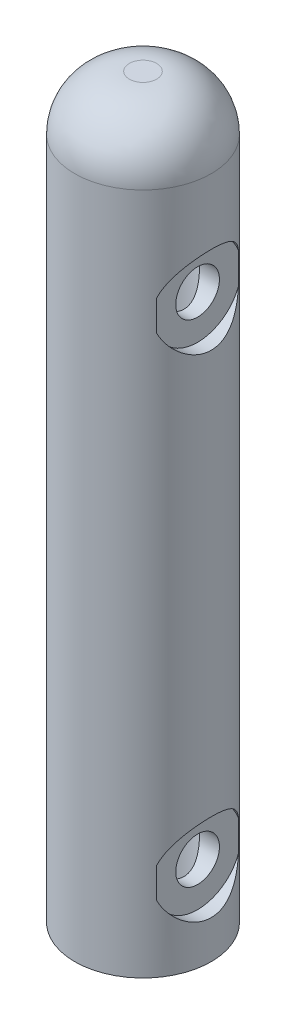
ISO-10303-21;
HEADER;
FILE_DESCRIPTION(('STEP AP214'),'2;1');
FILE_NAME('part.step','',(''),(''),'','','');
FILE_SCHEMA(('AUTOMOTIVE_DESIGN { 1 0 10303 214 1 1 1 1 }'));
ENDSEC;
DATA;
#1=APPLICATION_CONTEXT('core data for automotive mechanical design processes');
#2=APPLICATION_PROTOCOL_DEFINITION('international standard','automotive_design',2000,#1);
#3=PRODUCT_CONTEXT('',#1,'mechanical');
#4=PRODUCT('Part','Part','',(#3));
#5=PRODUCT_RELATED_PRODUCT_CATEGORY('part','',(#4));
#6=PRODUCT_DEFINITION_FORMATION('','',#4);
#7=PRODUCT_DEFINITION_CONTEXT('part definition',#1,'design');
#8=PRODUCT_DEFINITION('design','',#6,#7);
#9=PRODUCT_DEFINITION_SHAPE('','',#8);
#10=(LENGTH_UNIT() NAMED_UNIT(*) SI_UNIT(.MILLI.,.METRE.));
#11=(NAMED_UNIT(*) PLANE_ANGLE_UNIT() SI_UNIT($,.RADIAN.));
#12=(NAMED_UNIT(*) SI_UNIT($,.STERADIAN.) SOLID_ANGLE_UNIT());
#13=UNCERTAINTY_MEASURE_WITH_UNIT(LENGTH_MEASURE(1.E-05),#10,'distance_accuracy_value','');
#14=(GEOMETRIC_REPRESENTATION_CONTEXT(3) GLOBAL_UNCERTAINTY_ASSIGNED_CONTEXT((#13)) GLOBAL_UNIT_ASSIGNED_CONTEXT((#10,
#11,#12)) REPRESENTATION_CONTEXT('',''));
#15=CARTESIAN_POINT('',(0.,0.,0.));
#16=DIRECTION('',(0.,0.,1.));
#17=DIRECTION('',(1.,0.,0.));
#18=AXIS2_PLACEMENT_3D('',#15,#16,#17);
#19=CARTESIAN_POINT('',(0.,120.,0.));
#20=DIRECTION('',(0.,-1.,0.));
#21=DIRECTION('',(0.,0.,-1.));
#22=AXIS2_PLACEMENT_3D('',#19,#20,#21);
#23=CYLINDRICAL_SURFACE('',#22,12.5);
#24=CARTESIAN_POINT('',(-9.,109.974937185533,8.67467578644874));
#25=CARTESIAN_POINT('',(-9.07259251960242,110.106241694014,8.59936479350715));
#26=CARTESIAN_POINT('',(-9.14601169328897,110.235474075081,8.52129584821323));
#27=CARTESIAN_POINT('',(-9.29394603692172,110.489825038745,8.35969816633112));
#28=CARTESIAN_POINT('',(-9.36846116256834,110.614943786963,8.27616964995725));
#29=CARTESIAN_POINT('',(-9.5928905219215,110.984301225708,8.01739215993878));
#30=CARTESIAN_POINT('',(-9.74362267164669,111.222423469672,7.83401884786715));
#31=CARTESIAN_POINT('',(-10.0444087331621,111.683628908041,7.44452222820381));
#32=CARTESIAN_POINT('',(-10.1944485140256,111.906582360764,7.23823480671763));
#33=CARTESIAN_POINT('',(-10.4890728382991,112.334486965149,6.80427011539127));
#34=CARTESIAN_POINT('',(-10.6336591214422,112.539443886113,6.57659974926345));
#35=CARTESIAN_POINT('',(-10.8892147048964,112.895409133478,6.14221608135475));
#36=CARTESIAN_POINT('',(-11.001610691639,113.049551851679,5.93890489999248));
#37=CARTESIAN_POINT('',(-11.2185281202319,113.343573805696,5.51820778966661));
#38=CARTESIAN_POINT('',(-11.3230498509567,113.48345356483,5.30082237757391));
#39=CARTESIAN_POINT('',(-11.5220028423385,113.747229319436,4.8531703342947));
#40=CARTESIAN_POINT('',(-11.6164639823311,113.871172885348,4.62294512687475));
#41=CARTESIAN_POINT('',(-11.7937529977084,114.102092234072,4.14983897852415));
#42=CARTESIAN_POINT('',(-11.8765828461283,114.209070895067,3.90696019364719));
#43=CARTESIAN_POINT('',(-12.0163636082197,114.388590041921,3.45027392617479));
#44=CARTESIAN_POINT('',(-12.0753323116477,114.463901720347,3.23817047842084));
#45=CARTESIAN_POINT('',(-12.1827884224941,114.600631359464,2.80695801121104));
#46=CARTESIAN_POINT('',(-12.2312776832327,114.662051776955,2.58785023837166));
#47=CARTESIAN_POINT('',(-12.3168623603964,114.770168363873,2.14383237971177));
#48=CARTESIAN_POINT('',(-12.3539576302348,114.816864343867,1.9189222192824));
#49=CARTESIAN_POINT('',(-12.4159960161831,114.894822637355,1.46477344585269));
#50=CARTESIAN_POINT('',(-12.4409389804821,114.926084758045,1.23553477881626));
#51=CARTESIAN_POINT('',(-12.4781926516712,114.972737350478,0.773663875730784));
#52=CARTESIAN_POINT('',(-12.4904620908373,114.988075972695,0.541023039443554));
#53=CARTESIAN_POINT('',(-12.5019492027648,115.002437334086,0.0749134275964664));
#54=CARTESIAN_POINT('',(-12.5011668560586,115.001460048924,-0.158555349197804));
#55=CARTESIAN_POINT('',(-12.4865682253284,114.983206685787,-0.62444880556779));
#56=CARTESIAN_POINT('',(-12.4727515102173,114.965930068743,-0.856873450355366));
#57=CARTESIAN_POINT('',(-12.4323933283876,114.915373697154,-1.31884725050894));
#58=CARTESIAN_POINT('',(-12.40585213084,114.882094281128,-1.54839646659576));
#59=CARTESIAN_POINT('',(-12.3423475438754,114.802249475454,-1.99091963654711));
#60=CARTESIAN_POINT('',(-12.3060093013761,114.756479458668,-2.20412831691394));
#61=CARTESIAN_POINT('',(-12.2230895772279,114.651680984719,-2.62529278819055));
#62=CARTESIAN_POINT('',(-12.1765047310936,114.592648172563,-2.83324682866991));
#63=CARTESIAN_POINT('',(-12.0739150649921,114.462085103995,-3.24270081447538));
#64=CARTESIAN_POINT('',(-12.0179138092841,114.390559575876,-3.4442031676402));
#65=CARTESIAN_POINT('',(-11.8973556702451,114.235768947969,-3.84001852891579));
#66=CARTESIAN_POINT('',(-11.8327977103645,114.152502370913,-4.03433062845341));
#67=CARTESIAN_POINT('',(-11.6894007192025,113.966378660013,-4.43364246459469));
#68=CARTESIAN_POINT('',(-11.6097832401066,113.862403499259,-4.63784109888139));
#69=CARTESIAN_POINT('',(-11.4426431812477,113.642291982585,-5.03612582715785));
#70=CARTESIAN_POINT('',(-11.3551216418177,113.526157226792,-5.2302132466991));
#71=CARTESIAN_POINT('',(-11.1732509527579,113.282399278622,-5.60825658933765));
#72=CARTESIAN_POINT('',(-11.0788893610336,113.154755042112,-5.79219292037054));
#73=CARTESIAN_POINT('',(-10.8847406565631,112.8889678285,-6.14928757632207));
#74=CARTESIAN_POINT('',(-10.784953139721,112.75082406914,-6.32244509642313));
#75=CARTESIAN_POINT('',(-10.5489633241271,112.419443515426,-6.71089085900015));
#76=CARTESIAN_POINT('',(-10.4112253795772,112.222600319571,-6.9221838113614));
#77=CARTESIAN_POINT('',(-10.1313784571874,111.813017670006,-7.3256731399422));
#78=CARTESIAN_POINT('',(-9.98926808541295,111.600273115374,-7.51786334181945));
#79=CARTESIAN_POINT('',(-9.70435954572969,111.160564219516,-7.88217016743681));
#80=CARTESIAN_POINT('',(-9.56156703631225,110.933665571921,-8.05437025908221));
#81=CARTESIAN_POINT('',(-9.34902361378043,110.582374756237,-8.2980349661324));
#82=CARTESIAN_POINT('',(-9.27846304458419,110.463477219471,-8.37680396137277));
#83=CARTESIAN_POINT('',(-9.13835340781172,110.221986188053,-8.52943369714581));
#84=CARTESIAN_POINT('',(-9.06880437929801,110.099392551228,-8.60329424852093));
#85=CARTESIAN_POINT('',(-9.,109.974937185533,-8.67467578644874));
#86=B_SPLINE_CURVE_WITH_KNOTS('',3,(#24,#25,#26,#27,#28,#29,#30,#31,#32,#33,#34,#35,#36,#37,#38,
#39,#40,#41,#42,#43,#44,#45,#46,#47,#48,#49,#50,#51,#52,#53,#54,#55,#56,#57,#58,#59,#60,#61,#62,
#63,#64,#65,#66,#67,#68,#69,#70,#71,#72,#73,#74,#75,#76,#77,#78,#79,#80,#81,#82,#83,#84,#85),
.UNSPECIFIED.,.F.,.F.,(4,2,2,2,2,2,2,2,2,2,2,2,2,2,2,2,2,2,2,2,2,2,2,2,2,2,2,2,2,2,4),(0.,
0.503542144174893,1.00706399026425,2.0145590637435,3.02980230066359,4.04471887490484,
4.88035587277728,5.71596219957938,6.54901323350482,7.38192278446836,8.0792409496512,
8.77643569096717,9.47363940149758,10.1708518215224,10.8703274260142,11.5698040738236,
12.2693038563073,12.9687888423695,13.6312954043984,14.2940198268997,14.9564939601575,
15.6190515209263,16.3461101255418,17.0730731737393,17.8013934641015,18.5297680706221,
19.4885013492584,20.4475435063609,21.4024250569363,21.8796877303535,22.3569687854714),.UNSPECIFIED.);
#87=CARTESIAN_POINT('',(-9.,109.974937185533,8.67467578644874));
#88=VERTEX_POINT('',#87);
#89=CARTESIAN_POINT('',(-9.,109.974937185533,-8.67467578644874));
#90=VERTEX_POINT('',#89);
#91=EDGE_CURVE('E45',#88,#90,#86,.T.);
#92=ORIENTED_EDGE('',*,*,#91,.F.);
#93=DIRECTION('',(0.,-1.,0.));
#94=VECTOR('',#93,1.);
#95=CARTESIAN_POINT('',(-9.,120.,8.67467578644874));
#96=LINE('',#95,#94);
#97=CARTESIAN_POINT('',(-9.,100.025062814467,8.67467578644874));
#98=VERTEX_POINT('',#97);
#99=EDGE_CURVE('E100',#88,#98,#96,.T.);
#100=ORIENTED_EDGE('',*,*,#99,.T.);
#101=CARTESIAN_POINT('',(-9.,100.025062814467,-8.67467578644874));
#102=CARTESIAN_POINT('',(-9.07259251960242,99.8937583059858,-8.59936479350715));
#103=CARTESIAN_POINT('',(-9.14601169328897,99.7645259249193,-8.52129584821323));
#104=CARTESIAN_POINT('',(-9.29394603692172,99.5101749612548,-8.35969816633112));
#105=CARTESIAN_POINT('',(-9.36846116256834,99.385056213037,-8.27616964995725));
#106=CARTESIAN_POINT('',(-9.5928905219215,99.0156987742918,-8.01739215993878));
#107=CARTESIAN_POINT('',(-9.74362267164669,98.7775765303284,-7.83401884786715));
#108=CARTESIAN_POINT('',(-10.0444087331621,98.3163710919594,-7.44452222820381));
#109=CARTESIAN_POINT('',(-10.1944485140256,98.0934176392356,-7.23823480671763));
#110=CARTESIAN_POINT('',(-10.4890728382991,97.6655130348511,-6.80427011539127));
#111=CARTESIAN_POINT('',(-10.6336591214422,97.4605561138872,-6.57659974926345));
#112=CARTESIAN_POINT('',(-10.8892147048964,97.1045908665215,-6.14221608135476));
#113=CARTESIAN_POINT('',(-11.001610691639,96.9504481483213,-5.93890489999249));
#114=CARTESIAN_POINT('',(-11.2185281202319,96.6564261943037,-5.51820778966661));
#115=CARTESIAN_POINT('',(-11.3230498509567,96.5165464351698,-5.30082237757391));
#116=CARTESIAN_POINT('',(-11.5220028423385,96.2527706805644,-4.85317033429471));
#117=CARTESIAN_POINT('',(-11.6164639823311,96.1288271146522,-4.62294512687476));
#118=CARTESIAN_POINT('',(-11.7937529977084,95.8979077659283,-4.14983897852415));
#119=CARTESIAN_POINT('',(-11.8765828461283,95.7909291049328,-3.90696019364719));
#120=CARTESIAN_POINT('',(-12.0163636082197,95.6114099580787,-3.45027392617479));
#121=CARTESIAN_POINT('',(-12.0753323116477,95.5360982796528,-3.23817047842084));
#122=CARTESIAN_POINT('',(-12.1827884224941,95.3993686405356,-2.80695801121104));
#123=CARTESIAN_POINT('',(-12.2312776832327,95.3379482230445,-2.58785023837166));
#124=CARTESIAN_POINT('',(-12.3168623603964,95.2298316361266,-2.14383237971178));
#125=CARTESIAN_POINT('',(-12.3539576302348,95.1831356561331,-1.91892221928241));
#126=CARTESIAN_POINT('',(-12.4159960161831,95.1051773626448,-1.4647734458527));
#127=CARTESIAN_POINT('',(-12.4409389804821,95.0739152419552,-1.23553477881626));
#128=CARTESIAN_POINT('',(-12.4781926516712,95.0272626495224,-0.773663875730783));
#129=CARTESIAN_POINT('',(-12.4904620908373,95.0119240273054,-0.541023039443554));
#130=CARTESIAN_POINT('',(-12.5019492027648,94.9975626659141,-0.0749134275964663));
#131=CARTESIAN_POINT('',(-12.5011668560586,94.9985399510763,0.158555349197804));
#132=CARTESIAN_POINT('',(-12.4865682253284,95.0167933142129,0.62444880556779));
#133=CARTESIAN_POINT('',(-12.4727515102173,95.0340699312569,0.856873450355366));
#134=CARTESIAN_POINT('',(-12.4323933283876,95.0846263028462,1.31884725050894));
#135=CARTESIAN_POINT('',(-12.40585213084,95.1179057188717,1.54839646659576));
#136=CARTESIAN_POINT('',(-12.3423475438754,95.1977505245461,1.99091963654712));
#137=CARTESIAN_POINT('',(-12.3060093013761,95.2435205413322,2.20412831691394));
#138=CARTESIAN_POINT('',(-12.2230895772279,95.3483190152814,2.62529278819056));
#139=CARTESIAN_POINT('',(-12.1765047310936,95.4073518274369,2.83324682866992));
#140=CARTESIAN_POINT('',(-12.0739150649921,95.537914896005,3.24270081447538));
#141=CARTESIAN_POINT('',(-12.0179138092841,95.6094404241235,3.44420316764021));
#142=CARTESIAN_POINT('',(-11.8973556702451,95.7642310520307,3.8400185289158));
#143=CARTESIAN_POINT('',(-11.8327977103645,95.8474976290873,4.03433062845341));
#144=CARTESIAN_POINT('',(-11.6894007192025,96.0336213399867,4.43364246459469));
#145=CARTESIAN_POINT('',(-11.6097832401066,96.1375965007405,4.63784109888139));
#146=CARTESIAN_POINT('',(-11.4426431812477,96.3577080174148,5.03612582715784));
#147=CARTESIAN_POINT('',(-11.3551216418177,96.4738427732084,5.23021324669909));
#148=CARTESIAN_POINT('',(-11.1732509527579,96.7176007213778,5.60825658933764));
#149=CARTESIAN_POINT('',(-11.0788893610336,96.8452449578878,5.79219292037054));
#150=CARTESIAN_POINT('',(-10.8847406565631,97.1110321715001,6.14928757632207));
#151=CARTESIAN_POINT('',(-10.784953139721,97.2491759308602,6.32244509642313));
#152=CARTESIAN_POINT('',(-10.5489633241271,97.5805564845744,6.71089085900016));
#153=CARTESIAN_POINT('',(-10.4112253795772,97.7773996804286,6.9221838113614));
#154=CARTESIAN_POINT('',(-10.1313784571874,98.1869823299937,7.3256731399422));
#155=CARTESIAN_POINT('',(-9.98926808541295,98.3997268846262,7.51786334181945));
#156=CARTESIAN_POINT('',(-9.70435954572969,98.8394357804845,7.88217016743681));
#157=CARTESIAN_POINT('',(-9.56156703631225,99.0663344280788,8.05437025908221));
#158=CARTESIAN_POINT('',(-9.34902361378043,99.417625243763,8.2980349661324));
#159=CARTESIAN_POINT('',(-9.27846304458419,99.5365227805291,8.37680396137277));
#160=CARTESIAN_POINT('',(-9.13835340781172,99.7780138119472,8.52943369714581));
#161=CARTESIAN_POINT('',(-9.06880437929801,99.9006074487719,8.60329424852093));
#162=CARTESIAN_POINT('',(-9.,100.025062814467,8.67467578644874));
#163=B_SPLINE_CURVE_WITH_KNOTS('',3,(#101,#102,#103,#104,#105,#106,#107,#108,#109,#110,#111,
#112,#113,#114,#115,#116,#117,#118,#119,#120,#121,#122,#123,#124,#125,#126,#127,#128,#129,#130,
#131,#132,#133,#134,#135,#136,#137,#138,#139,#140,#141,#142,#143,#144,#145,#146,#147,#148,#149,
#150,#151,#152,#153,#154,#155,#156,#157,#158,#159,#160,#161,#162),.UNSPECIFIED.,.F.,.F.,(4,2,2,
2,2,2,2,2,2,2,2,2,2,2,2,2,2,2,2,2,2,2,2,2,2,2,2,2,2,2,4),(0.,0.503542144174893,1.00706399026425,
2.0145590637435,3.02980230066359,4.04471887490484,4.88035587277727,5.71596219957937,
6.54901323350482,7.38192278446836,8.07924094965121,8.77643569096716,9.47363940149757,
10.1708518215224,10.8703274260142,11.5698040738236,12.2693038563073,12.9687888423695,
13.6312954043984,14.2940198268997,14.9564939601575,15.6190515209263,16.3461101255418,
17.0730731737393,17.8013934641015,18.5297680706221,19.4885013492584,20.4475435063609,
21.4024250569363,21.8796877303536,22.3569687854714),.UNSPECIFIED.);
#164=CARTESIAN_POINT('',(-9.,100.025062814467,-8.67467578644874));
#165=VERTEX_POINT('',#164);
#166=EDGE_CURVE('E11',#165,#98,#163,.T.);
#167=ORIENTED_EDGE('',*,*,#166,.F.);
#168=DIRECTION('',(0.,-1.,0.));
#169=VECTOR('',#168,1.);
#170=CARTESIAN_POINT('',(-9.,120.,-8.67467578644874));
#171=LINE('',#170,#169);
#172=EDGE_CURVE('E108',#165,#90,#171,.F.);
#173=ORIENTED_EDGE('',*,*,#172,.T.);
#174=EDGE_LOOP('',(#92,#100,#167,#173));
#175=FACE_BOUND('',#174,.T.);
#176=CARTESIAN_POINT('',(-9.,19.9749371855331,8.67467578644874));
#177=CARTESIAN_POINT('',(-9.07259251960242,20.1062416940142,8.59936479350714));
#178=CARTESIAN_POINT('',(-9.14601169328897,20.2354740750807,8.52129584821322));
#179=CARTESIAN_POINT('',(-9.29394603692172,20.4898250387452,8.35969816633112));
#180=CARTESIAN_POINT('',(-9.36846116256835,20.614943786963,8.27616964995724));
#181=CARTESIAN_POINT('',(-9.59289052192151,20.9843012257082,8.01739215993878));
#182=CARTESIAN_POINT('',(-9.74362267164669,21.2224234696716,7.83401884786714));
#183=CARTESIAN_POINT('',(-10.0444087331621,21.6836289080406,7.4445222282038));
#184=CARTESIAN_POINT('',(-10.1944485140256,21.9065823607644,7.23823480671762));
#185=CARTESIAN_POINT('',(-10.4890728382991,22.3344869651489,6.80427011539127));
#186=CARTESIAN_POINT('',(-10.6336591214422,22.5394438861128,6.57659974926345));
#187=CARTESIAN_POINT('',(-10.8892147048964,22.8954091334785,6.14221608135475));
#188=CARTESIAN_POINT('',(-11.001610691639,23.0495518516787,5.93890489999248));
#189=CARTESIAN_POINT('',(-11.2185281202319,23.3435738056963,5.5182077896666));
#190=CARTESIAN_POINT('',(-11.3230498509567,23.4834535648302,5.3008223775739));
#191=CARTESIAN_POINT('',(-11.5220028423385,23.7472293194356,4.8531703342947));
#192=CARTESIAN_POINT('',(-11.6164639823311,23.8711728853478,4.62294512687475));
#193=CARTESIAN_POINT('',(-11.7937529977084,24.1020922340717,4.14983897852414));
#194=CARTESIAN_POINT('',(-11.8765828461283,24.2090708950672,3.90696019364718));
#195=CARTESIAN_POINT('',(-12.0163636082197,24.3885900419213,3.45027392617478));
#196=CARTESIAN_POINT('',(-12.0753323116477,24.4639017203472,3.23817047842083));
#197=CARTESIAN_POINT('',(-12.1827884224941,24.6006313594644,2.80695801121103));
#198=CARTESIAN_POINT('',(-12.2312776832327,24.6620517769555,2.58785023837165));
#199=CARTESIAN_POINT('',(-12.3168623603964,24.7701683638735,2.14383237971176));
#200=CARTESIAN_POINT('',(-12.3539576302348,24.8168643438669,1.91892221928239));
#201=CARTESIAN_POINT('',(-12.4159960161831,24.8948226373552,1.46477344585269));
#202=CARTESIAN_POINT('',(-12.4409389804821,24.9260847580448,1.23553477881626));
#203=CARTESIAN_POINT('',(-12.4781926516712,24.9727373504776,0.773663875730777));
#204=CARTESIAN_POINT('',(-12.4904620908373,24.9880759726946,0.541023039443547));
#205=CARTESIAN_POINT('',(-12.5019492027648,25.0024373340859,0.0749134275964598));
#206=CARTESIAN_POINT('',(-12.5011668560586,25.0014600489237,-0.15855534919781));
#207=CARTESIAN_POINT('',(-12.4865682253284,24.9832066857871,-0.624448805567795));
#208=CARTESIAN_POINT('',(-12.4727515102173,24.9659300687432,-0.856873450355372));
#209=CARTESIAN_POINT('',(-12.4323933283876,24.9153736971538,-1.31884725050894));
#210=CARTESIAN_POINT('',(-12.40585213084,24.8820942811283,-1.54839646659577));
#211=CARTESIAN_POINT('',(-12.3423475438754,24.8022494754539,-1.99091963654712));
#212=CARTESIAN_POINT('',(-12.3060093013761,24.7564794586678,-2.20412831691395));
#213=CARTESIAN_POINT('',(-12.2230895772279,24.6516809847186,-2.62529278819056));
#214=CARTESIAN_POINT('',(-12.1765047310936,24.5926481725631,-2.83324682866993));
#215=CARTESIAN_POINT('',(-12.0739150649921,24.4620851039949,-3.24270081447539));
#216=CARTESIAN_POINT('',(-12.0179138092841,24.3905595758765,-3.44420316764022));
#217=CARTESIAN_POINT('',(-11.8973556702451,24.2357689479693,-3.8400185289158));
#218=CARTESIAN_POINT('',(-11.8327977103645,24.1525023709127,-4.03433062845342));
#219=CARTESIAN_POINT('',(-11.6894007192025,23.9663786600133,-4.4336424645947));
#220=CARTESIAN_POINT('',(-11.6097832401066,23.8624034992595,-4.6378410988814));
#221=CARTESIAN_POINT('',(-11.4426431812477,23.6422919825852,-5.03612582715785));
#222=CARTESIAN_POINT('',(-11.3551216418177,23.5261572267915,-5.2302132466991));
#223=CARTESIAN_POINT('',(-11.1732509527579,23.2823992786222,-5.60825658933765));
#224=CARTESIAN_POINT('',(-11.0788893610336,23.1547550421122,-5.79219292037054));
#225=CARTESIAN_POINT('',(-10.8847406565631,22.8889678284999,-6.14928757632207));
#226=CARTESIAN_POINT('',(-10.784953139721,22.7508240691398,-6.32244509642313));
#227=CARTESIAN_POINT('',(-10.5489633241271,22.4194435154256,-6.71089085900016));
#228=CARTESIAN_POINT('',(-10.4112253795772,22.2226003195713,-6.92218381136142));
#229=CARTESIAN_POINT('',(-10.1313784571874,21.8130176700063,-7.32567313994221));
#230=CARTESIAN_POINT('',(-9.98926808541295,21.6002731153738,-7.51786334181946));
#231=CARTESIAN_POINT('',(-9.70435954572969,21.1605642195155,-7.88217016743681));
#232=CARTESIAN_POINT('',(-9.56156703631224,20.9336655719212,-8.05437025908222));
#233=CARTESIAN_POINT('',(-9.34902361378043,20.582374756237,-8.29803496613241));
#234=CARTESIAN_POINT('',(-9.27846304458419,20.4634772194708,-8.37680396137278));
#235=CARTESIAN_POINT('',(-9.13835340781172,20.2219861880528,-8.52943369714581));
#236=CARTESIAN_POINT('',(-9.06880437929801,20.0993925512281,-8.60329424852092));
#237=CARTESIAN_POINT('',(-9.,19.9749371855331,-8.67467578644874));
#238=B_SPLINE_CURVE_WITH_KNOTS('',3,(#176,#177,#178,#179,#180,#181,#182,#183,#184,#185,#186,
#187,#188,#189,#190,#191,#192,#193,#194,#195,#196,#197,#198,#199,#200,#201,#202,#203,#204,#205,
#206,#207,#208,#209,#210,#211,#212,#213,#214,#215,#216,#217,#218,#219,#220,#221,#222,#223,#224,
#225,#226,#227,#228,#229,#230,#231,#232,#233,#234,#235,#236,#237),.UNSPECIFIED.,.F.,.F.,(4,2,2,
2,2,2,2,2,2,2,2,2,2,2,2,2,2,2,2,2,2,2,2,2,2,2,2,2,2,2,4),(0.,0.503542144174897,1.00706399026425,
2.0145590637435,3.02980230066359,4.04471887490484,4.88035587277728,5.71596219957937,
6.54901323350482,7.38192278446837,8.07924094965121,8.77643569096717,9.47363940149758,
10.1708518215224,10.8703274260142,11.5698040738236,12.2693038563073,12.9687888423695,
13.6312954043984,14.2940198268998,14.9564939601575,15.6190515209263,16.3461101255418,
17.0730731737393,17.8013934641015,18.5297680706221,19.4885013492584,20.4475435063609,
21.4024250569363,21.8796877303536,22.3569687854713),.UNSPECIFIED.);
#239=CARTESIAN_POINT('',(-9.,19.9749371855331,8.67467578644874));
#240=VERTEX_POINT('',#239);
#241=CARTESIAN_POINT('',(-9.,19.9749371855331,-8.67467578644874));
#242=VERTEX_POINT('',#241);
#243=EDGE_CURVE('E117',#240,#242,#238,.T.);
#244=ORIENTED_EDGE('',*,*,#243,.F.);
#245=DIRECTION('',(0.,-1.,0.));
#246=VECTOR('',#245,1.);
#247=CARTESIAN_POINT('',(-9.,120.,8.67467578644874));
#248=LINE('',#247,#246);
#249=CARTESIAN_POINT('',(-9.,10.0250628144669,8.67467578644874));
#250=VERTEX_POINT('',#249);
#251=EDGE_CURVE('E215',#240,#250,#248,.T.);
#252=ORIENTED_EDGE('',*,*,#251,.T.);
#253=CARTESIAN_POINT('',(-9.,10.0250628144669,-8.67467578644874));
#254=CARTESIAN_POINT('',(-9.07259251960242,9.89375830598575,-8.59936479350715));
#255=CARTESIAN_POINT('',(-9.14601169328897,9.76452592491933,-8.52129584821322));
#256=CARTESIAN_POINT('',(-9.29394603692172,9.51017496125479,-8.35969816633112));
#257=CARTESIAN_POINT('',(-9.36846116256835,9.38505621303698,-8.27616964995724));
#258=CARTESIAN_POINT('',(-9.59289052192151,9.0156987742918,-8.01739215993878));
#259=CARTESIAN_POINT('',(-9.7436226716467,8.77757653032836,-7.83401884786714));
#260=CARTESIAN_POINT('',(-10.0444087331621,8.31637109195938,-7.4445222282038));
#261=CARTESIAN_POINT('',(-10.1944485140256,8.09341763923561,-7.23823480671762));
#262=CARTESIAN_POINT('',(-10.4890728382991,7.66551303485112,-6.80427011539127));
#263=CARTESIAN_POINT('',(-10.6336591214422,7.46055611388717,-6.57659974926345));
#264=CARTESIAN_POINT('',(-10.8892147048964,7.10459086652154,-6.14221608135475));
#265=CARTESIAN_POINT('',(-11.001610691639,6.95044814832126,-5.93890489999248));
#266=CARTESIAN_POINT('',(-11.2185281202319,6.65642619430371,-5.5182077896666));
#267=CARTESIAN_POINT('',(-11.3230498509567,6.5165464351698,-5.3008223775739));
#268=CARTESIAN_POINT('',(-11.5220028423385,6.25277068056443,-4.8531703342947));
#269=CARTESIAN_POINT('',(-11.6164639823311,6.12882711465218,-4.62294512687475));
#270=CARTESIAN_POINT('',(-11.7937529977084,5.89790776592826,-4.14983897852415));
#271=CARTESIAN_POINT('',(-11.8765828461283,5.79092910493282,-3.90696019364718));
#272=CARTESIAN_POINT('',(-12.0163636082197,5.61140995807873,-3.45027392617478));
#273=CARTESIAN_POINT('',(-12.0753323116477,5.53609827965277,-3.23817047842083));
#274=CARTESIAN_POINT('',(-12.1827884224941,5.39936864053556,-2.80695801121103));
#275=CARTESIAN_POINT('',(-12.2312776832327,5.33794822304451,-2.58785023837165));
#276=CARTESIAN_POINT('',(-12.3168623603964,5.22983163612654,-2.14383237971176));
#277=CARTESIAN_POINT('',(-12.3539576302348,5.1831356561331,-1.9189222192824));
#278=CARTESIAN_POINT('',(-12.4159960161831,5.10517736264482,-1.46477344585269));
#279=CARTESIAN_POINT('',(-12.4409389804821,5.07391524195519,-1.23553477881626));
#280=CARTESIAN_POINT('',(-12.4781926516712,5.02726264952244,-0.773663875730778));
#281=CARTESIAN_POINT('',(-12.4904620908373,5.01192402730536,-0.541023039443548));
#282=CARTESIAN_POINT('',(-12.5019492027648,4.9975626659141,-0.0749134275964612));
#283=CARTESIAN_POINT('',(-12.5011668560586,4.99853995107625,0.158555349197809));
#284=CARTESIAN_POINT('',(-12.4865682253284,5.01679331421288,0.624448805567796));
#285=CARTESIAN_POINT('',(-12.4727515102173,5.03406993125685,0.856873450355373));
#286=CARTESIAN_POINT('',(-12.4323933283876,5.08462630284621,1.31884725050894));
#287=CARTESIAN_POINT('',(-12.40585213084,5.11790571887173,1.54839646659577));
#288=CARTESIAN_POINT('',(-12.3423475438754,5.19775052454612,1.99091963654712));
#289=CARTESIAN_POINT('',(-12.3060093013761,5.24352054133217,2.20412831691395));
#290=CARTESIAN_POINT('',(-12.2230895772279,5.34831901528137,2.62529278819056));
#291=CARTESIAN_POINT('',(-12.1765047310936,5.40735182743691,2.83324682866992));
#292=CARTESIAN_POINT('',(-12.0739150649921,5.53791489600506,3.24270081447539));
#293=CARTESIAN_POINT('',(-12.0179138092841,5.60944042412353,3.44420316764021));
#294=CARTESIAN_POINT('',(-11.8973556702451,5.76423105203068,3.8400185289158));
#295=CARTESIAN_POINT('',(-11.8327977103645,5.84749762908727,4.03433062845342));
#296=CARTESIAN_POINT('',(-11.6894007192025,6.03362133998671,4.4336424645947));
#297=CARTESIAN_POINT('',(-11.6097832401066,6.13759650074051,4.6378410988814));
#298=CARTESIAN_POINT('',(-11.4426431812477,6.35770801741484,5.03612582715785));
#299=CARTESIAN_POINT('',(-11.3551216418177,6.47384277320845,5.2302132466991));
#300=CARTESIAN_POINT('',(-11.1732509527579,6.71760072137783,5.60825658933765));
#301=CARTESIAN_POINT('',(-11.0788893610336,6.84524495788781,5.79219292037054));
#302=CARTESIAN_POINT('',(-10.8847406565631,7.11103217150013,6.14928757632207));
#303=CARTESIAN_POINT('',(-10.784953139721,7.24917593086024,6.32244509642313));
#304=CARTESIAN_POINT('',(-10.5489633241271,7.5805564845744,6.71089085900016));
#305=CARTESIAN_POINT('',(-10.4112253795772,7.77739968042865,6.92218381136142));
#306=CARTESIAN_POINT('',(-10.1313784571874,8.18698232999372,7.32567313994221));
#307=CARTESIAN_POINT('',(-9.98926808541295,8.39972688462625,7.51786334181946));
#308=CARTESIAN_POINT('',(-9.70435954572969,8.83943578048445,7.88217016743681));
#309=CARTESIAN_POINT('',(-9.56156703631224,9.06633442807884,8.05437025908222));
#310=CARTESIAN_POINT('',(-9.34902361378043,9.41762524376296,8.29803496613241));
#311=CARTESIAN_POINT('',(-9.27846304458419,9.53652278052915,8.37680396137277));
#312=CARTESIAN_POINT('',(-9.13835340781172,9.7780138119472,8.5294336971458));
#313=CARTESIAN_POINT('',(-9.06880437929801,9.90060744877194,8.60329424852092));
#314=CARTESIAN_POINT('',(-9.,10.0250628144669,8.67467578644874));
#315=B_SPLINE_CURVE_WITH_KNOTS('',3,(#253,#254,#255,#256,#257,#258,#259,#260,#261,#262,#263,
#264,#265,#266,#267,#268,#269,#270,#271,#272,#273,#274,#275,#276,#277,#278,#279,#280,#281,#282,
#283,#284,#285,#286,#287,#288,#289,#290,#291,#292,#293,#294,#295,#296,#297,#298,#299,#300,#301,
#302,#303,#304,#305,#306,#307,#308,#309,#310,#311,#312,#313,#314),.UNSPECIFIED.,.F.,.F.,(4,2,2,
2,2,2,2,2,2,2,2,2,2,2,2,2,2,2,2,2,2,2,2,2,2,2,2,2,2,2,4),(0.,0.503542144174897,1.00706399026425,
2.0145590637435,3.02980230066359,4.04471887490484,4.88035587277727,5.71596219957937,
6.54901323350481,7.38192278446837,8.07924094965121,8.77643569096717,9.47363940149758,
10.1708518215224,10.8703274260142,11.5698040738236,12.2693038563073,12.9687888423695,
13.6312954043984,14.2940198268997,14.9564939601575,15.6190515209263,16.3461101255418,
17.0730731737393,17.8013934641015,18.5297680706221,19.4885013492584,20.4475435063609,
21.4024250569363,21.8796877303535,22.3569687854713),.UNSPECIFIED.);
#316=CARTESIAN_POINT('',(-9.,10.0250628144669,-8.67467578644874));
#317=VERTEX_POINT('',#316);
#318=EDGE_CURVE('E116',#317,#250,#315,.T.);
#319=ORIENTED_EDGE('',*,*,#318,.F.);
#320=DIRECTION('',(0.,-1.,0.));
#321=VECTOR('',#320,1.);
#322=CARTESIAN_POINT('',(-9.,120.,-8.67467578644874));
#323=LINE('',#322,#321);
#324=EDGE_CURVE('E157',#317,#242,#323,.F.);
#325=ORIENTED_EDGE('',*,*,#324,.T.);
#326=EDGE_LOOP('',(#244,#252,#319,#325));
#327=FACE_BOUND('',#326,.T.);
#328=DIRECTION('',(0.,-1.,0.));
#329=VECTOR('',#328,1.);
#330=CARTESIAN_POINT('',(10.,120.,7.5));
#331=LINE('',#330,#329);
#332=CARTESIAN_POINT('',(10.,17.783882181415,7.5));
#333=VERTEX_POINT('',#332);
#334=CARTESIAN_POINT('',(10.,12.216117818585,7.5));
#335=VERTEX_POINT('',#334);
#336=EDGE_CURVE('E227',#333,#335,#331,.T.);
#337=ORIENTED_EDGE('',*,*,#336,.F.);
#338=CARTESIAN_POINT('',(10.,17.783882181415,7.5));
#339=CARTESIAN_POINT('',(10.0616358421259,18.0052285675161,7.41782565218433));
#340=CARTESIAN_POINT('',(10.1286090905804,18.2214956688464,7.32641677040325));
#341=CARTESIAN_POINT('',(10.2704164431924,18.6429229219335,7.12625624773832));
#342=CARTESIAN_POINT('',(10.3452435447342,18.8480927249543,7.01752001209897));
#343=CARTESIAN_POINT('',(10.5001368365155,19.2469602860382,6.78357113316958));
#344=CARTESIAN_POINT('',(10.5802079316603,19.4406469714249,6.65834295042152));
#345=CARTESIAN_POINT('',(10.7430676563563,19.8158146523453,6.39224777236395));
#346=CARTESIAN_POINT('',(10.8258569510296,19.9972926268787,6.25137692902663));
#347=CARTESIAN_POINT('',(10.991621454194,20.3469020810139,5.95508186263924));
#348=CARTESIAN_POINT('',(11.0745955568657,20.5150682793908,5.79969796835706));
#349=CARTESIAN_POINT('',(11.2388400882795,20.8378789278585,5.47463525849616));
#350=CARTESIAN_POINT('',(11.3201105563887,20.9925236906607,5.30495677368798));
#351=CARTESIAN_POINT('',(11.4788954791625,21.2873246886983,4.95200787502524));
#352=CARTESIAN_POINT('',(11.556412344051,21.4274902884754,4.76874637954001));
#353=CARTESIAN_POINT('',(11.7058183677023,21.6923945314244,4.38923496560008));
#354=CARTESIAN_POINT('',(11.7777082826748,21.8171352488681,4.19298679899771));
#355=CARTESIAN_POINT('',(11.9042808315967,22.0333807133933,3.81727632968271));
#356=CARTESIAN_POINT('',(11.9599551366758,22.1270881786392,3.63941367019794));
#357=CARTESIAN_POINT('',(12.0646835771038,22.3014691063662,3.27555087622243));
#358=CARTESIAN_POINT('',(12.1137389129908,22.3821449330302,3.08955222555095));
#359=CARTESIAN_POINT('',(12.2041623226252,22.5296061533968,2.71042014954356));
#360=CARTESIAN_POINT('',(12.2455343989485,22.5963987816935,2.51729050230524));
#361=CARTESIAN_POINT('',(12.3196772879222,22.7153491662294,2.12494761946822));
#362=CARTESIAN_POINT('',(12.3524480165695,22.7675067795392,1.92573432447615));
#363=CARTESIAN_POINT('',(12.4087340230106,22.8567095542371,1.5215638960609));
#364=CARTESIAN_POINT('',(12.4322010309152,22.8936759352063,1.3165825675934));
#365=CARTESIAN_POINT('',(12.4690322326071,22.951557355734,0.903458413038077));
#366=CARTESIAN_POINT('',(12.4823963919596,22.9724723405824,0.695315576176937));
#367=CARTESIAN_POINT('',(12.4986628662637,22.9979165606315,0.277658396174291));
#368=CARTESIAN_POINT('',(12.501567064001,23.0024487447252,0.0681443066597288));
#369=CARTESIAN_POINT('',(12.4968387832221,22.995060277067,-0.350465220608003));
#370=CARTESIAN_POINT('',(12.4892069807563,22.9831406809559,-0.559560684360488));
#371=CARTESIAN_POINT('',(12.464729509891,22.9447891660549,-0.957468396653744));
#372=CARTESIAN_POINT('',(12.4487410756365,22.9197066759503,-1.14646589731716));
#373=CARTESIAN_POINT('',(12.4085014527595,22.8563037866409,-1.5213972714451));
#374=CARTESIAN_POINT('',(12.3842474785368,22.8179789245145,-1.70733008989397));
#375=CARTESIAN_POINT('',(12.3280041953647,22.7285764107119,-2.07481443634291));
#376=CARTESIAN_POINT('',(12.2960181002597,22.6775040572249,-2.25636775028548));
#377=CARTESIAN_POINT('',(12.2249395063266,22.563144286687,-2.61422133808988));
#378=CARTESIAN_POINT('',(12.1858442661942,22.499852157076,-2.79051955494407));
#379=CARTESIAN_POINT('',(12.0997249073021,22.3591139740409,-3.1433807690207));
#380=CARTESIAN_POINT('',(12.0524601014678,22.2812292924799,-3.31971007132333));
#381=CARTESIAN_POINT('',(11.952002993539,22.1137090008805,-3.66496970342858));
#382=CARTESIAN_POINT('',(11.8988085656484,22.0240691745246,-3.83389734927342));
#383=CARTESIAN_POINT('',(11.7317221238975,21.738490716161,-4.32870696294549));
#384=CARTESIAN_POINT('',(11.6103244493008,21.525889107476,-4.64262551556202));
#385=CARTESIAN_POINT('',(11.3375420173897,21.0282092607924,-5.27693127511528));
#386=CARTESIAN_POINT('',(11.1843542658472,20.7371078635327,-5.59177726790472));
#387=CARTESIAN_POINT('',(10.8757370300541,20.1094412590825,-6.1705512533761));
#388=CARTESIAN_POINT('',(10.7203092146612,19.7729084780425,-6.43451523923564));
#389=CARTESIAN_POINT('',(10.46572145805,19.1633740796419,-6.83796595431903));
#390=CARTESIAN_POINT('',(10.3634445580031,18.9007493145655,-6.99124066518));
#391=CARTESIAN_POINT('',(10.2191508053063,18.4924547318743,-7.19903292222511));
#392=CARTESIAN_POINT('',(10.1725737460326,18.3539656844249,-7.26460960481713));
#393=CARTESIAN_POINT('',(10.0832258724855,18.0723410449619,-7.38812330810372));
#394=CARTESIAN_POINT('',(10.0404570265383,17.9292031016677,-7.44605638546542));
#395=CARTESIAN_POINT('',(10.,17.783882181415,-7.50000000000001));
#396=B_SPLINE_CURVE_WITH_KNOTS('',3,(#338,#339,#340,#341,#342,#343,#344,#345,#346,#347,#348,
#349,#350,#351,#352,#353,#354,#355,#356,#357,#358,#359,#360,#361,#362,#363,#364,#365,#366,#367,
#368,#369,#370,#371,#372,#373,#374,#375,#376,#377,#378,#379,#380,#381,#382,#383,#384,#385,#386,
#387,#388,#389,#390,#391,#392,#393,#394,#395),.UNSPECIFIED.,.F.,.F.,(4,2,2,2,2,2,2,2,2,2,2,2,2,
2,2,2,2,2,2,2,2,2,2,2,2,2,2,2,4),(0.,0.731561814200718,1.4624768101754,2.19408550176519,
2.92587456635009,3.65568743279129,4.38548341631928,5.11480440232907,5.84402720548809,
6.46921357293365,7.09428639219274,7.71903266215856,8.34378503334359,8.97173762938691,
9.59969236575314,10.227534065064,10.8553354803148,11.4286454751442,12.0021488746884,
12.5754143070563,13.148901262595,13.7437030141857,14.3387186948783,15.5287174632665,
16.8895547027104,18.2494257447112,19.2098343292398,19.6900250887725,20.1704626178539),.UNSPECIFIED.);
#397=CARTESIAN_POINT('',(10.,17.783882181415,-7.5));
#398=VERTEX_POINT('',#397);
#399=EDGE_CURVE('E196',#333,#398,#396,.T.);
#400=ORIENTED_EDGE('',*,*,#399,.T.);
#401=DIRECTION('',(0.,-1.,0.));
#402=VECTOR('',#401,1.);
#403=CARTESIAN_POINT('',(10.,120.,-7.5));
#404=LINE('',#403,#402);
#405=CARTESIAN_POINT('',(10.,12.216117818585,-7.5));
#406=VERTEX_POINT('',#405);
#407=EDGE_CURVE('E225',#406,#398,#404,.F.);
#408=ORIENTED_EDGE('',*,*,#407,.F.);
#409=CARTESIAN_POINT('',(10.,12.216117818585,-7.5));
#410=CARTESIAN_POINT('',(10.0616358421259,11.9947714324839,-7.41782565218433));
#411=CARTESIAN_POINT('',(10.1286090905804,11.7785043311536,-7.32641677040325));
#412=CARTESIAN_POINT('',(10.2704164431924,11.3570770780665,-7.12625624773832));
#413=CARTESIAN_POINT('',(10.3452435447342,11.1519072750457,-7.01752001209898));
#414=CARTESIAN_POINT('',(10.5001368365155,10.7530397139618,-6.78357113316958));
#415=CARTESIAN_POINT('',(10.5802079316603,10.5593530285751,-6.65834295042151));
#416=CARTESIAN_POINT('',(10.7430676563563,10.1841853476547,-6.39224777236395));
#417=CARTESIAN_POINT('',(10.8258569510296,10.0027073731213,-6.25137692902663));
#418=CARTESIAN_POINT('',(10.991621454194,9.65309791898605,-5.95508186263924));
#419=CARTESIAN_POINT('',(11.0745955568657,9.48493172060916,-5.79969796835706));
#420=CARTESIAN_POINT('',(11.2388400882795,9.1621210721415,-5.47463525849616));
#421=CARTESIAN_POINT('',(11.3201105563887,9.0074763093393,-5.30495677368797));
#422=CARTESIAN_POINT('',(11.4788954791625,8.71267531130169,-4.95200787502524));
#423=CARTESIAN_POINT('',(11.556412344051,8.57250971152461,-4.76874637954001));
#424=CARTESIAN_POINT('',(11.7058183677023,8.30760546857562,-4.38923496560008));
#425=CARTESIAN_POINT('',(11.7777082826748,8.18286475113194,-4.19298679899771));
#426=CARTESIAN_POINT('',(11.9042808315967,7.96661928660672,-3.81727632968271));
#427=CARTESIAN_POINT('',(11.9599551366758,7.87291182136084,-3.63941367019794));
#428=CARTESIAN_POINT('',(12.0646835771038,7.69853089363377,-3.27555087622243));
#429=CARTESIAN_POINT('',(12.1137389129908,7.6178550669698,-3.08955222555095));
#430=CARTESIAN_POINT('',(12.2041623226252,7.47039384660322,-2.71042014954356));
#431=CARTESIAN_POINT('',(12.2455343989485,7.40360121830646,-2.51729050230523));
#432=CARTESIAN_POINT('',(12.3196772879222,7.28465083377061,-2.12494761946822));
#433=CARTESIAN_POINT('',(12.3524480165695,7.23249322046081,-1.92573432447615));
#434=CARTESIAN_POINT('',(12.4087340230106,7.14329044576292,-1.5215638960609));
#435=CARTESIAN_POINT('',(12.4322010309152,7.10632406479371,-1.3165825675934));
#436=CARTESIAN_POINT('',(12.4690322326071,7.04844264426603,-0.903458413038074));
#437=CARTESIAN_POINT('',(12.4823963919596,7.02752765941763,-0.695315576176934));
#438=CARTESIAN_POINT('',(12.4986628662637,7.00208343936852,-0.277658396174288));
#439=CARTESIAN_POINT('',(12.501567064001,6.99755125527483,-0.0681443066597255));
#440=CARTESIAN_POINT('',(12.4968387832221,7.00493972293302,0.350465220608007));
#441=CARTESIAN_POINT('',(12.4892069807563,7.01685931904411,0.559560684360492));
#442=CARTESIAN_POINT('',(12.464729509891,7.05521083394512,0.957468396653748));
#443=CARTESIAN_POINT('',(12.4487410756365,7.08029332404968,1.14646589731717));
#444=CARTESIAN_POINT('',(12.4085014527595,7.14369621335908,1.5213972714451));
#445=CARTESIAN_POINT('',(12.3842474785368,7.18202107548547,1.70733008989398));
#446=CARTESIAN_POINT('',(12.3280041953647,7.27142358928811,2.07481443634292));
#447=CARTESIAN_POINT('',(12.2960181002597,7.3224959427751,2.25636775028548));
#448=CARTESIAN_POINT('',(12.2249395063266,7.43685571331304,2.61422133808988));
#449=CARTESIAN_POINT('',(12.1858442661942,7.50014784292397,2.79051955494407));
#450=CARTESIAN_POINT('',(12.0997249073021,7.64088602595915,3.1433807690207));
#451=CARTESIAN_POINT('',(12.0524601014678,7.71877070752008,3.31971007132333));
#452=CARTESIAN_POINT('',(11.952002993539,7.88629099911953,3.66496970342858));
#453=CARTESIAN_POINT('',(11.8988085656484,7.97593082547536,3.83389734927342));
#454=CARTESIAN_POINT('',(11.7317221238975,8.26150928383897,4.32870696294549));
#455=CARTESIAN_POINT('',(11.6103244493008,8.47411089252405,4.64262551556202));
#456=CARTESIAN_POINT('',(11.3375420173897,8.97179073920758,5.27693127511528));
#457=CARTESIAN_POINT('',(11.1843542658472,9.26289213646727,5.59177726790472));
#458=CARTESIAN_POINT('',(10.8757370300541,9.8905587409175,6.1705512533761));
#459=CARTESIAN_POINT('',(10.7203092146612,10.2270915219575,6.43451523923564));
#460=CARTESIAN_POINT('',(10.46572145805,10.8366259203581,6.83796595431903));
#461=CARTESIAN_POINT('',(10.3634445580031,11.0992506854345,6.99124066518));
#462=CARTESIAN_POINT('',(10.2191508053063,11.5075452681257,7.1990329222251));
#463=CARTESIAN_POINT('',(10.1725737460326,11.6460343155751,7.26460960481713));
#464=CARTESIAN_POINT('',(10.0832258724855,11.9276589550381,7.38812330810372));
#465=CARTESIAN_POINT('',(10.0404570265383,12.0707968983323,7.44605638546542));
#466=CARTESIAN_POINT('',(10.,12.216117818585,7.50000000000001));
#467=B_SPLINE_CURVE_WITH_KNOTS('',3,(#409,#410,#411,#412,#413,#414,#415,#416,#417,#418,#419,
#420,#421,#422,#423,#424,#425,#426,#427,#428,#429,#430,#431,#432,#433,#434,#435,#436,#437,#438,
#439,#440,#441,#442,#443,#444,#445,#446,#447,#448,#449,#450,#451,#452,#453,#454,#455,#456,#457,
#458,#459,#460,#461,#462,#463,#464,#465,#466),.UNSPECIFIED.,.F.,.F.,(4,2,2,2,2,2,2,2,2,2,2,2,2,
2,2,2,2,2,2,2,2,2,2,2,2,2,2,2,4),(0.,0.731561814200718,1.46247681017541,2.19408550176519,
2.92587456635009,3.65568743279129,4.38548341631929,5.11480440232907,5.84402720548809,
6.46921357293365,7.09428639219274,7.71903266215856,8.34378503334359,8.97173762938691,
9.59969236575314,10.227534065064,10.8553354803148,11.4286454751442,12.0021488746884,
12.5754143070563,13.148901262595,13.7437030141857,14.3387186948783,15.5287174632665,
16.8895547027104,18.2494257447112,19.2098343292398,19.6900250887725,20.1704626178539),.UNSPECIFIED.);
#468=EDGE_CURVE('E190',#406,#335,#467,.T.);
#469=ORIENTED_EDGE('',*,*,#468,.T.);
#470=EDGE_LOOP('',(#337,#400,#408,#469));
#471=FACE_BOUND('',#470,.T.);
#472=CARTESIAN_POINT('',(0.,125.,0.));
#473=DIRECTION('',(0.,1.,0.));
#474=DIRECTION('',(0.,0.,1.));
#475=AXIS2_PLACEMENT_3D('',#472,#473,#474);
#476=CIRCLE('',#475,12.5);
#477=CARTESIAN_POINT('',(0.,125.,12.5));
#478=VERTEX_POINT('',#477);
#479=EDGE_CURVE('E457',#478,#478,#476,.F.);
#480=ORIENTED_EDGE('',*,*,#479,.T.);
#481=EDGE_LOOP('',(#480));
#482=FACE_BOUND('',#481,.T.);
#483=CARTESIAN_POINT('',(0.,0.,0.));
#484=DIRECTION('',(0.,1.,0.));
#485=DIRECTION('',(0.,0.,1.));
#486=AXIS2_PLACEMENT_3D('',#483,#484,#485);
#487=CIRCLE('',#486,12.5);
#488=CARTESIAN_POINT('',(0.,0.,12.5));
#489=VERTEX_POINT('',#488);
#490=EDGE_CURVE('E460',#489,#489,#487,.T.);
#491=ORIENTED_EDGE('',*,*,#490,.T.);
#492=EDGE_LOOP('',(#491));
#493=FACE_BOUND('',#492,.T.);
#494=DIRECTION('',(0.,-1.,0.));
#495=VECTOR('',#494,1.);
#496=CARTESIAN_POINT('',(10.,120.,7.5));
#497=LINE('',#496,#495);
#498=CARTESIAN_POINT('',(10.,107.783882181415,7.5));
#499=VERTEX_POINT('',#498);
#500=CARTESIAN_POINT('',(10.,102.216117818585,7.5));
#501=VERTEX_POINT('',#500);
#502=EDGE_CURVE('E207',#499,#501,#497,.T.);
#503=ORIENTED_EDGE('',*,*,#502,.F.);
#504=CARTESIAN_POINT('',(10.,107.783882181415,7.5));
#505=CARTESIAN_POINT('',(10.0616358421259,108.005228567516,7.41782565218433));
#506=CARTESIAN_POINT('',(10.1286090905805,108.221495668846,7.32641677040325));
#507=CARTESIAN_POINT('',(10.2704164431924,108.642922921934,7.12625624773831));
#508=CARTESIAN_POINT('',(10.3452435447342,108.848092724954,7.01752001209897));
#509=CARTESIAN_POINT('',(10.5001368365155,109.246960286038,6.78357113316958));
#510=CARTESIAN_POINT('',(10.5802079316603,109.440646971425,6.65834295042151));
#511=CARTESIAN_POINT('',(10.7430676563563,109.815814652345,6.39224777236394));
#512=CARTESIAN_POINT('',(10.8258569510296,109.997292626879,6.25137692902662));
#513=CARTESIAN_POINT('',(10.991621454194,110.346902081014,5.95508186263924));
#514=CARTESIAN_POINT('',(11.0745955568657,110.515068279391,5.79969796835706));
#515=CARTESIAN_POINT('',(11.2388400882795,110.837878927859,5.47463525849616));
#516=CARTESIAN_POINT('',(11.3201105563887,110.992523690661,5.30495677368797));
#517=CARTESIAN_POINT('',(11.4788954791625,111.287324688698,4.95200787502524));
#518=CARTESIAN_POINT('',(11.556412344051,111.427490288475,4.76874637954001));
#519=CARTESIAN_POINT('',(11.7058183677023,111.692394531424,4.38923496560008));
#520=CARTESIAN_POINT('',(11.7777082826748,111.817135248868,4.19298679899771));
#521=CARTESIAN_POINT('',(11.9042808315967,112.033380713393,3.8172763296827));
#522=CARTESIAN_POINT('',(11.9599551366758,112.127088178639,3.63941367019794));
#523=CARTESIAN_POINT('',(12.0646835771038,112.301469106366,3.27555087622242));
#524=CARTESIAN_POINT('',(12.1137389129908,112.38214493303,3.08955222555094));
#525=CARTESIAN_POINT('',(12.2041623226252,112.529606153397,2.71042014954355));
#526=CARTESIAN_POINT('',(12.2455343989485,112.596398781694,2.51729050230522));
#527=CARTESIAN_POINT('',(12.3196772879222,112.715349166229,2.12494761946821));
#528=CARTESIAN_POINT('',(12.3524480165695,112.767506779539,1.92573432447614));
#529=CARTESIAN_POINT('',(12.4087340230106,112.856709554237,1.52156389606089));
#530=CARTESIAN_POINT('',(12.4322010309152,112.893675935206,1.31658256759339));
#531=CARTESIAN_POINT('',(12.4690322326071,112.951557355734,0.903458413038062));
#532=CARTESIAN_POINT('',(12.4823963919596,112.972472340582,0.695315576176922));
#533=CARTESIAN_POINT('',(12.4986628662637,112.997916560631,0.277658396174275));
#534=CARTESIAN_POINT('',(12.501567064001,113.002448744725,0.0681443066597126));
#535=CARTESIAN_POINT('',(12.4968387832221,112.995060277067,-0.35046522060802));
#536=CARTESIAN_POINT('',(12.4892069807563,112.983140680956,-0.559560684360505));
#537=CARTESIAN_POINT('',(12.464729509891,112.944789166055,-0.95746839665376));
#538=CARTESIAN_POINT('',(12.4487410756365,112.91970667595,-1.14646589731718));
#539=CARTESIAN_POINT('',(12.4085014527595,112.856303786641,-1.52139727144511));
#540=CARTESIAN_POINT('',(12.3842474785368,112.817978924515,-1.70733008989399));
#541=CARTESIAN_POINT('',(12.3280041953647,112.728576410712,-2.07481443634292));
#542=CARTESIAN_POINT('',(12.2960181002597,112.677504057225,-2.2563677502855));
#543=CARTESIAN_POINT('',(12.2249395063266,112.563144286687,-2.61422133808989));
#544=CARTESIAN_POINT('',(12.1858442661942,112.499852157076,-2.79051955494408));
#545=CARTESIAN_POINT('',(12.0997249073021,112.359113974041,-3.14338076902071));
#546=CARTESIAN_POINT('',(12.0524601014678,112.28122929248,-3.31971007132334));
#547=CARTESIAN_POINT('',(11.952002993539,112.11370900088,-3.6649697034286));
#548=CARTESIAN_POINT('',(11.8988085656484,112.024069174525,-3.83389734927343));
#549=CARTESIAN_POINT('',(11.7317221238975,111.738490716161,-4.3287069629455));
#550=CARTESIAN_POINT('',(11.6103244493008,111.525889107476,-4.64262551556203));
#551=CARTESIAN_POINT('',(11.3375420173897,111.028209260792,-5.27693127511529));
#552=CARTESIAN_POINT('',(11.1843542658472,110.737107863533,-5.59177726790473));
#553=CARTESIAN_POINT('',(10.8757370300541,110.109441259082,-6.17055125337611));
#554=CARTESIAN_POINT('',(10.7203092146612,109.772908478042,-6.43451523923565));
#555=CARTESIAN_POINT('',(10.46572145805,109.163374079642,-6.83796595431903));
#556=CARTESIAN_POINT('',(10.3634445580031,108.900749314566,-6.99124066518));
#557=CARTESIAN_POINT('',(10.2191508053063,108.492454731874,-7.19903292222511));
#558=CARTESIAN_POINT('',(10.1725737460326,108.353965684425,-7.26460960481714));
#559=CARTESIAN_POINT('',(10.0832258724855,108.072341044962,-7.38812330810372));
#560=CARTESIAN_POINT('',(10.0404570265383,107.929203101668,-7.44605638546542));
#561=CARTESIAN_POINT('',(10.,107.783882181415,-7.5));
#562=B_SPLINE_CURVE_WITH_KNOTS('',3,(#504,#505,#506,#507,#508,#509,#510,#511,#512,#513,#514,
#515,#516,#517,#518,#519,#520,#521,#522,#523,#524,#525,#526,#527,#528,#529,#530,#531,#532,#533,
#534,#535,#536,#537,#538,#539,#540,#541,#542,#543,#544,#545,#546,#547,#548,#549,#550,#551,#552,
#553,#554,#555,#556,#557,#558,#559,#560,#561),.UNSPECIFIED.,.F.,.F.,(4,2,2,2,2,2,2,2,2,2,2,2,2,
2,2,2,2,2,2,2,2,2,2,2,2,2,2,2,4),(0.,0.731561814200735,1.46247681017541,2.1940855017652,
2.92587456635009,3.65568743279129,4.38548341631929,5.11480440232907,5.84402720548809,
6.46921357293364,7.09428639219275,7.71903266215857,8.34378503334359,8.97173762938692,
9.59969236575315,10.227534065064,10.8553354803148,11.4286454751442,12.0021488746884,
12.5754143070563,13.148901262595,13.7437030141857,14.3387186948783,15.5287174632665,
16.8895547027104,18.2494257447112,19.2098343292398,19.6900250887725,20.1704626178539),.UNSPECIFIED.);
#563=CARTESIAN_POINT('',(10.,107.783882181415,-7.5));
#564=VERTEX_POINT('',#563);
#565=EDGE_CURVE('E153',#499,#564,#562,.T.);
#566=ORIENTED_EDGE('',*,*,#565,.T.);
#567=DIRECTION('',(0.,-1.,0.));
#568=VECTOR('',#567,1.);
#569=CARTESIAN_POINT('',(10.,120.,-7.5));
#570=LINE('',#569,#568);
#571=CARTESIAN_POINT('',(10.,102.216117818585,-7.5));
#572=VERTEX_POINT('',#571);
#573=EDGE_CURVE('E203',#572,#564,#570,.F.);
#574=ORIENTED_EDGE('',*,*,#573,.F.);
#575=CARTESIAN_POINT('',(10.,102.216117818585,-7.5));
#576=CARTESIAN_POINT('',(10.0616358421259,101.994771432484,-7.41782565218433));
#577=CARTESIAN_POINT('',(10.1286090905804,101.778504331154,-7.32641677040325));
#578=CARTESIAN_POINT('',(10.2704164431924,101.357077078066,-7.12625624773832));
#579=CARTESIAN_POINT('',(10.3452435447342,101.151907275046,-7.01752001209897));
#580=CARTESIAN_POINT('',(10.5001368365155,100.753039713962,-6.78357113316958));
#581=CARTESIAN_POINT('',(10.5802079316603,100.559353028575,-6.65834295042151));
#582=CARTESIAN_POINT('',(10.7430676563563,100.184185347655,-6.39224777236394));
#583=CARTESIAN_POINT('',(10.8258569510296,100.002707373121,-6.25137692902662));
#584=CARTESIAN_POINT('',(10.991621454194,99.653097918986,-5.95508186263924));
#585=CARTESIAN_POINT('',(11.0745955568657,99.4849317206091,-5.79969796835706));
#586=CARTESIAN_POINT('',(11.2388400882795,99.1621210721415,-5.47463525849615));
#587=CARTESIAN_POINT('',(11.3201105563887,99.0074763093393,-5.30495677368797));
#588=CARTESIAN_POINT('',(11.4788954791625,98.7126753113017,-4.95200787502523));
#589=CARTESIAN_POINT('',(11.556412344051,98.5725097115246,-4.76874637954));
#590=CARTESIAN_POINT('',(11.7058183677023,98.3076054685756,-4.38923496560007));
#591=CARTESIAN_POINT('',(11.7777082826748,98.1828647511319,-4.19298679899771));
#592=CARTESIAN_POINT('',(11.9042808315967,97.9666192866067,-3.8172763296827));
#593=CARTESIAN_POINT('',(11.9599551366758,97.8729118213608,-3.63941367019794));
#594=CARTESIAN_POINT('',(12.0646835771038,97.6985308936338,-3.27555087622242));
#595=CARTESIAN_POINT('',(12.1137389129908,97.6178550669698,-3.08955222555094));
#596=CARTESIAN_POINT('',(12.2041623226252,97.4703938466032,-2.71042014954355));
#597=CARTESIAN_POINT('',(12.2455343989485,97.4036012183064,-2.51729050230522));
#598=CARTESIAN_POINT('',(12.3196772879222,97.2846508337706,-2.12494761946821));
#599=CARTESIAN_POINT('',(12.3524480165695,97.2324932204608,-1.92573432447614));
#600=CARTESIAN_POINT('',(12.4087340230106,97.1432904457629,-1.52156389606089));
#601=CARTESIAN_POINT('',(12.4322010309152,97.1063240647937,-1.31658256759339));
#602=CARTESIAN_POINT('',(12.4690322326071,97.048442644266,-0.903458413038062));
#603=CARTESIAN_POINT('',(12.4823963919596,97.0275276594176,-0.695315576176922));
#604=CARTESIAN_POINT('',(12.4986628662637,97.0020834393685,-0.277658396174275));
#605=CARTESIAN_POINT('',(12.501567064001,96.9975512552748,-0.0681443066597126));
#606=CARTESIAN_POINT('',(12.4968387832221,97.004939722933,0.35046522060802));
#607=CARTESIAN_POINT('',(12.4892069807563,97.0168593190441,0.559560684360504));
#608=CARTESIAN_POINT('',(12.464729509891,97.0552108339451,0.957468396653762));
#609=CARTESIAN_POINT('',(12.4487410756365,97.0802933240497,1.14646589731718));
#610=CARTESIAN_POINT('',(12.4085014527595,97.1436962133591,1.52139727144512));
#611=CARTESIAN_POINT('',(12.3842474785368,97.1820210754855,1.70733008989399));
#612=CARTESIAN_POINT('',(12.3280041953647,97.2714235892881,2.07481443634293));
#613=CARTESIAN_POINT('',(12.2960181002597,97.3224959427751,2.2563677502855));
#614=CARTESIAN_POINT('',(12.2249395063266,97.436855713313,2.6142213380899));
#615=CARTESIAN_POINT('',(12.1858442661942,97.500147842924,2.79051955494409));
#616=CARTESIAN_POINT('',(12.0997249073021,97.6408860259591,3.14338076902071));
#617=CARTESIAN_POINT('',(12.0524601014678,97.7187707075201,3.31971007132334));
#618=CARTESIAN_POINT('',(11.952002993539,97.8862909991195,3.6649697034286));
#619=CARTESIAN_POINT('',(11.8988085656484,97.9759308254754,3.83389734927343));
#620=CARTESIAN_POINT('',(11.7317221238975,98.261509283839,4.3287069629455));
#621=CARTESIAN_POINT('',(11.6103244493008,98.474110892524,4.64262551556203));
#622=CARTESIAN_POINT('',(11.3375420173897,98.9717907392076,5.27693127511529));
#623=CARTESIAN_POINT('',(11.1843542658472,99.2628921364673,5.59177726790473));
#624=CARTESIAN_POINT('',(10.8757370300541,99.8905587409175,6.17055125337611));
#625=CARTESIAN_POINT('',(10.7203092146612,100.227091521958,6.43451523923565));
#626=CARTESIAN_POINT('',(10.46572145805,100.836625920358,6.83796595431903));
#627=CARTESIAN_POINT('',(10.3634445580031,101.099250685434,6.99124066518));
#628=CARTESIAN_POINT('',(10.2191508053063,101.507545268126,7.1990329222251));
#629=CARTESIAN_POINT('',(10.1725737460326,101.646034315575,7.26460960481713));
#630=CARTESIAN_POINT('',(10.0832258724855,101.927658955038,7.38812330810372));
#631=CARTESIAN_POINT('',(10.0404570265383,102.070796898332,7.44605638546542));
#632=CARTESIAN_POINT('',(10.,102.216117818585,7.5));
#633=B_SPLINE_CURVE_WITH_KNOTS('',3,(#575,#576,#577,#578,#579,#580,#581,#582,#583,#584,#585,
#586,#587,#588,#589,#590,#591,#592,#593,#594,#595,#596,#597,#598,#599,#600,#601,#602,#603,#604,
#605,#606,#607,#608,#609,#610,#611,#612,#613,#614,#615,#616,#617,#618,#619,#620,#621,#622,#623,
#624,#625,#626,#627,#628,#629,#630,#631,#632),.UNSPECIFIED.,.F.,.F.,(4,2,2,2,2,2,2,2,2,2,2,2,2,
2,2,2,2,2,2,2,2,2,2,2,2,2,2,2,4),(0.,0.731561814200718,1.46247681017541,2.1940855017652,
2.92587456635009,3.65568743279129,4.38548341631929,5.11480440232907,5.84402720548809,
6.46921357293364,7.09428639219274,7.71903266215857,8.34378503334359,8.97173762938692,
9.59969236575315,10.227534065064,10.8553354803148,11.4286454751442,12.0021488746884,
12.5754143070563,13.148901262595,13.7437030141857,14.3387186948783,15.5287174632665,
16.8895547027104,18.2494257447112,19.2098343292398,19.6900250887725,20.1704626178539),.UNSPECIFIED.);
#634=EDGE_CURVE('E163',#572,#501,#633,.T.);
#635=ORIENTED_EDGE('',*,*,#634,.T.);
#636=EDGE_LOOP('',(#503,#566,#574,#635));
#637=FACE_BOUND('',#636,.T.);
#638=ADVANCED_FACE('F33',(#175,#327,#471,#482,#493,#637),#23,.T.);
#639=CARTESIAN_POINT('',(12.501,105.,0.));
#640=DIRECTION('',(-1.,0.,0.));
#641=DIRECTION('',(0.,0.,1.));
#642=AXIS2_PLACEMENT_3D('',#639,#640,#641);
#643=CYLINDRICAL_SURFACE('',#642,4.);
#644=CARTESIAN_POINT('',(6.34428877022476,105.,4.));
#645=CARTESIAN_POINT('',(6.34428830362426,105.103140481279,4.00000036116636));
#646=CARTESIAN_POINT('',(6.34681238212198,105.206276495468,3.99600566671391));
#647=CARTESIAN_POINT('',(6.35680645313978,105.411729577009,3.98008789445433));
#648=CARTESIAN_POINT('',(6.36427830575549,105.514046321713,3.96816183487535));
#649=CARTESIAN_POINT('',(6.38389222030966,105.717153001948,3.93652969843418));
#650=CARTESIAN_POINT('',(6.39604041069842,105.81794075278,3.91681341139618));
#651=CARTESIAN_POINT('',(6.42455191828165,106.017158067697,3.86986831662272));
#652=CARTESIAN_POINT('',(6.44091710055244,106.115586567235,3.84263618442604));
#653=CARTESIAN_POINT('',(6.49528574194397,106.405141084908,3.75051454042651));
#654=CARTESIAN_POINT('',(6.5387143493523,106.591974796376,3.67496986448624));
#655=CARTESIAN_POINT('',(6.63499735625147,106.950154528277,3.49812708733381));
#656=CARTESIAN_POINT('',(6.68785328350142,107.121498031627,3.39682481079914));
#657=CARTESIAN_POINT('',(6.80312517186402,107.46180950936,3.16012884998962));
#658=CARTESIAN_POINT('',(6.86597249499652,107.629019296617,3.02241665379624));
#659=CARTESIAN_POINT('',(6.99070595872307,107.939421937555,2.72148987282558));
#660=CARTESIAN_POINT('',(7.0525915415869,108.08260129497,2.55826105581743));
#661=CARTESIAN_POINT('',(7.1426455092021,108.281958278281,2.28965803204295));
#662=CARTESIAN_POINT('',(7.17323616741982,108.347874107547,2.19218068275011));
#663=CARTESIAN_POINT('',(7.23160286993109,108.471171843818,1.99119263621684));
#664=CARTESIAN_POINT('',(7.2593801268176,108.528557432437,1.88768456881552));
#665=CARTESIAN_POINT('',(7.31132412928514,108.634222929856,1.67526048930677));
#666=CARTESIAN_POINT('',(7.33549110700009,108.682503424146,1.56634482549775));
#667=CARTESIAN_POINT('',(7.37947845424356,108.769364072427,1.34392506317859));
#668=CARTESIAN_POINT('',(7.39930140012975,108.807949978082,1.23042373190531));
#669=CARTESIAN_POINT('',(7.43262328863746,108.872284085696,1.00879348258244));
#670=CARTESIAN_POINT('',(7.44649710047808,108.898803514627,0.900944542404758));
#671=CARTESIAN_POINT('',(7.46964064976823,108.942826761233,0.682985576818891));
#672=CARTESIAN_POINT('',(7.47891273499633,108.960335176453,0.572876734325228));
#673=CARTESIAN_POINT('',(7.49258884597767,108.986101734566,0.351320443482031));
#674=CARTESIAN_POINT('',(7.49699462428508,108.994363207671,0.239873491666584));
#675=CARTESIAN_POINT('',(7.50081261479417,109.001524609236,0.0165987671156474));
#676=CARTESIAN_POINT('',(7.50022519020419,109.000425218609,-0.095228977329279));
#677=CARTESIAN_POINT('',(7.49437902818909,108.989453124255,-0.30722167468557));
#678=CARTESIAN_POINT('',(7.48958821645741,108.980459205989,-0.407445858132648));
#679=CARTESIAN_POINT('',(7.47609058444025,108.955001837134,-0.606683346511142));
#680=CARTESIAN_POINT('',(7.46738251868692,108.938536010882,-0.70569625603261));
#681=CARTESIAN_POINT('',(7.43566388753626,108.878185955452,-0.999812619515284));
#682=CARTESIAN_POINT('',(7.40705283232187,108.823338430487,-1.1921926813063));
#683=CARTESIAN_POINT('',(7.33703480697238,108.685863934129,-1.56677227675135));
#684=CARTESIAN_POINT('',(7.29547849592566,108.60291170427,-1.74882205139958));
#685=CARTESIAN_POINT('',(7.20317443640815,108.412139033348,-2.09683305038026));
#686=CARTESIAN_POINT('',(7.15242360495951,108.304310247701,-2.26278884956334));
#687=CARTESIAN_POINT('',(7.04014494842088,108.054079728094,-2.59223860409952));
#688=CARTESIAN_POINT('',(6.97804534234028,107.909253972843,-2.75369756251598));
#689=CARTESIAN_POINT('',(6.85319448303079,107.595579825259,-3.05119735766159));
#690=CARTESIAN_POINT('',(6.79044266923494,107.426708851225,-3.18721401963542));
#691=CARTESIAN_POINT('',(6.6658002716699,107.053316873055,-3.44073017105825));
#692=CARTESIAN_POINT('',(6.60437206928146,106.847031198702,-3.55590786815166));
#693=CARTESIAN_POINT('',(6.52360492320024,106.522638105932,-3.70076234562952));
#694=CARTESIAN_POINT('',(6.49857494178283,106.411991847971,-3.74440046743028));
#695=CARTESIAN_POINT('',(6.45332075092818,106.18639266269,-3.82186664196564));
#696=CARTESIAN_POINT('',(6.43309338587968,106.07144262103,-3.85570113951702));
#697=CARTESIAN_POINT('',(6.39977370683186,105.847557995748,-3.91073492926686));
#698=CARTESIAN_POINT('',(6.3862377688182,105.738885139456,-3.93273271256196));
#699=CARTESIAN_POINT('',(6.36459759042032,105.519606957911,-3.96765953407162));
#700=CARTESIAN_POINT('',(6.3564903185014,105.409002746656,-3.98059363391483));
#701=CARTESIAN_POINT('',(6.34607201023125,105.186891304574,-3.99718238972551));
#702=CARTESIAN_POINT('',(6.3437576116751,105.075384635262,-4.00084242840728));
#703=CARTESIAN_POINT('',(6.34502488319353,104.852496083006,-3.99883249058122));
#704=CARTESIAN_POINT('',(6.34860600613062,104.741114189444,-3.99316337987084));
#705=CARTESIAN_POINT('',(6.36063535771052,104.534295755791,-3.97396833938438));
#706=CARTESIAN_POINT('',(6.3683727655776,104.438709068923,-3.96158788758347));
#707=CARTESIAN_POINT('',(6.3878781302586,104.249064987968,-3.93005725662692));
#708=CARTESIAN_POINT('',(6.39964739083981,104.155008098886,-3.91090488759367));
#709=CARTESIAN_POINT('',(6.44046230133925,103.87604478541,-3.84359837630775));
#710=CARTESIAN_POINT('',(6.47502296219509,103.694223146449,-3.78558312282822));
#711=CARTESIAN_POINT('',(6.55667740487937,103.335038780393,-3.64239055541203));
#712=CARTESIAN_POINT('',(6.60425843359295,103.158230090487,-3.55612415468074));
#713=CARTESIAN_POINT('',(6.70628228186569,102.820514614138,-3.35976377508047));
#714=CARTESIAN_POINT('',(6.76072858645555,102.65961597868,-3.24965767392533));
#715=CARTESIAN_POINT('',(6.87995159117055,102.333528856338,-2.98991165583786));
#716=CARTESIAN_POINT('',(6.94506930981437,102.171194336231,-2.83683827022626));
#717=CARTESIAN_POINT('',(7.07159638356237,101.873394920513,-2.50479844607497));
#718=CARTESIAN_POINT('',(7.13300388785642,101.737943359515,-2.3258192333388));
#719=CARTESIAN_POINT('',(7.21889091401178,101.555380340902,-2.03675011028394));
#720=CARTESIAN_POINT('',(7.24697909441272,101.497014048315,-1.93468262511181));
#721=CARTESIAN_POINT('',(7.29970230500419,101.389200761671,-1.72510702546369));
#722=CARTESIAN_POINT('',(7.32433887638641,101.339749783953,-1.61760136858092));
#723=CARTESIAN_POINT('',(7.36942043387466,101.250353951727,-1.39793131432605));
#724=CARTESIAN_POINT('',(7.38986774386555,101.210403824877,-1.28576954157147));
#725=CARTESIAN_POINT('',(7.4259525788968,101.140509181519,-1.05761863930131));
#726=CARTESIAN_POINT('',(7.44159076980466,101.110563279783,-0.941630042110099));
#727=CARTESIAN_POINT('',(7.46626527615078,101.063570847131,-0.718479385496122));
#728=CARTESIAN_POINT('',(7.47580150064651,101.045541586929,-0.611578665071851));
#729=CARTESIAN_POINT('',(7.4902952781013,101.018209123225,-0.396363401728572));
#730=CARTESIAN_POINT('',(7.49525326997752,101.00890508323,-0.288048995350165));
#731=CARTESIAN_POINT('',(7.50045011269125,100.9991539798,-0.0709496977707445));
#732=CARTESIAN_POINT('',(7.50069072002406,100.998703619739,0.0378350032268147));
#733=CARTESIAN_POINT('',(7.49645091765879,101.006657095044,0.254983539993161));
#734=CARTESIAN_POINT('',(7.49197070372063,101.015060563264,0.36334739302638));
#735=CARTESIAN_POINT('',(7.47896770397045,101.03956357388,0.569969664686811));
#736=CARTESIAN_POINT('',(7.47080392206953,101.05498049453,0.668332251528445));
#737=CARTESIAN_POINT('',(7.4507958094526,101.093004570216,0.863288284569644));
#738=CARTESIAN_POINT('',(7.43895023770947,101.115614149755,0.959881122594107));
#739=CARTESIAN_POINT('',(7.39827359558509,101.19388806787,1.24600292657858));
#740=CARTESIAN_POINT('',(7.36429057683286,101.260019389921,1.43205516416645));
#741=CARTESIAN_POINT('',(7.28399359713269,101.420674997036,1.79715929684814));
#742=CARTESIAN_POINT('',(7.23726296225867,101.516175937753,1.97568263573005));
#743=CARTESIAN_POINT('',(7.13602243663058,101.731688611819,2.31484960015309));
#744=CARTESIAN_POINT('',(7.08150919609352,101.851710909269,2.47548547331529));
#745=CARTESIAN_POINT('',(6.96281363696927,102.128058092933,2.79303532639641));
#746=CARTESIAN_POINT('',(6.89822811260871,102.286927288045,2.94758313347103));
#747=CARTESIAN_POINT('',(6.77108894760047,102.628760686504,3.2289669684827));
#748=CARTESIAN_POINT('',(6.70853761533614,102.811751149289,3.35577238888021));
#749=CARTESIAN_POINT('',(6.62001185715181,103.106851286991,3.52559711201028));
#750=CARTESIAN_POINT('',(6.59071626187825,103.211614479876,3.57990094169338));
#751=CARTESIAN_POINT('',(6.53573201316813,103.42629623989,3.6793246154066));
#752=CARTESIAN_POINT('',(6.51004151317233,103.536212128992,3.724449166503));
#753=CARTESIAN_POINT('',(6.46336317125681,103.76022925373,3.80487821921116));
#754=CARTESIAN_POINT('',(6.44236369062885,103.874319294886,3.84020707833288));
#755=CARTESIAN_POINT('',(6.40595027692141,104.105984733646,3.90064740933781));
#756=CARTESIAN_POINT('',(6.3905326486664,104.22355776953,3.92576564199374));
#757=CARTESIAN_POINT('',(6.3671234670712,104.450584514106,3.9636079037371));
#758=CARTESIAN_POINT('',(6.35859431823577,104.559832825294,3.97723402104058));
#759=CARTESIAN_POINT('',(6.34717711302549,104.779389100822,3.99543004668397));
#760=CARTESIAN_POINT('',(6.34428926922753,104.889697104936,3.99999961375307));
#761=CARTESIAN_POINT('',(6.34428877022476,105.,4.));
#762=B_SPLINE_CURVE_WITH_KNOTS('',3,(#644,#645,#646,#647,#648,#649,#650,#651,#652,#653,#654,
#655,#656,#657,#658,#659,#660,#661,#662,#663,#664,#665,#666,#667,#668,#669,#670,#671,#672,#673,
#674,#675,#676,#677,#678,#679,#680,#681,#682,#683,#684,#685,#686,#687,#688,#689,#690,#691,#692,
#693,#694,#695,#696,#697,#698,#699,#700,#701,#702,#703,#704,#705,#706,#707,#708,#709,#710,#711,
#712,#713,#714,#715,#716,#717,#718,#719,#720,#721,#722,#723,#724,#725,#726,#727,#728,#729,#730,
#731,#732,#733,#734,#735,#736,#737,#738,#739,#740,#741,#742,#743,#744,#745,#746,#747,#748,#749,
#750,#751,#752,#753,#754,#755,#756,#757,#758,#759,#760,#761),.UNSPECIFIED.,.T.,.F.,(4,2,2,2,2,2,
2,2,2,2,2,2,2,2,2,2,2,2,2,2,2,2,2,2,2,2,2,2,2,2,2,2,2,2,2,2,2,2,2,2,2,2,2,2,2,2,2,2,2,2,2,2,2,2,
2,2,2,2,4),(0.,0.309306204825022,0.618728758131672,0.92855820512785,1.23852491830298,
1.85411962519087,2.46981418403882,3.14375489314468,3.81807285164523,4.1824182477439,
4.54660593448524,4.91077019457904,5.27471788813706,5.61002887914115,5.94516861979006,
6.28018762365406,6.61518225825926,6.91703282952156,7.21897944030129,7.82228215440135,
8.43282001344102,9.04356296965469,9.71755822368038,10.3921906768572,11.1202885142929,
11.4844677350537,11.8484070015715,12.1830181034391,12.5174421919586,12.8516721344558,
13.1858710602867,13.475612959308,13.7654486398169,14.3447543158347,14.9497143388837,
15.5549827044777,16.2493340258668,16.9440289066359,17.3062683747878,17.6683455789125,
18.0302213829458,18.3920470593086,18.7180939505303,19.0441095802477,19.3700038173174,
19.6958845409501,19.9952213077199,20.294659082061,20.892996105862,21.5138963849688,
22.1350647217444,22.8247691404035,23.5152306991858,23.8795582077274,24.2436984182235,
24.6069248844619,24.9699104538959,25.3006834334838,25.6314688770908),.UNSPECIFIED.);
#763=CARTESIAN_POINT('',(6.34428877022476,105.,4.));
#764=VERTEX_POINT('',#763);
#765=EDGE_CURVE('E236',#764,#764,#762,.T.);
#766=ORIENTED_EDGE('',*,*,#765,.T.);
#767=EDGE_LOOP('',(#766));
#768=FACE_BOUND('',#767,.T.);
#769=CARTESIAN_POINT('',(10.,105.,0.));
#770=DIRECTION('',(1.,0.,0.));
#771=DIRECTION('',(0.,0.,-1.));
#772=AXIS2_PLACEMENT_3D('',#769,#770,#771);
#773=CIRCLE('',#772,4.);
#774=CARTESIAN_POINT('',(10.,105.,-4.));
#775=VERTEX_POINT('',#774);
#776=EDGE_CURVE('E201',#775,#775,#773,.T.);
#777=ORIENTED_EDGE('',*,*,#776,.T.);
#778=EDGE_LOOP('',(#777));
#779=FACE_BOUND('',#778,.T.);
#780=ADVANCED_FACE('F247',(#768,#779),#643,.F.);
#781=CARTESIAN_POINT('',(12.501,15.,0.));
#782=DIRECTION('',(-1.,0.,0.));
#783=DIRECTION('',(0.,0.,1.));
#784=AXIS2_PLACEMENT_3D('',#781,#782,#783);
#785=CYLINDRICAL_SURFACE('',#784,4.);
#786=CARTESIAN_POINT('',(6.34428877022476,15.,4.));
#787=CARTESIAN_POINT('',(6.34428830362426,15.1031404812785,4.00000036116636));
#788=CARTESIAN_POINT('',(6.34681238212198,15.206276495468,3.99600566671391));
#789=CARTESIAN_POINT('',(6.35680645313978,15.4117295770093,3.98008789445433));
#790=CARTESIAN_POINT('',(6.36427830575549,15.5140463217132,3.96816183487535));
#791=CARTESIAN_POINT('',(6.38389222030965,15.7171530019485,3.93652969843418));
#792=CARTESIAN_POINT('',(6.39604041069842,15.8179407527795,3.91681341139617));
#793=CARTESIAN_POINT('',(6.42455191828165,16.0171580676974,3.86986831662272));
#794=CARTESIAN_POINT('',(6.44091710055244,16.1155865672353,3.84263618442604));
#795=CARTESIAN_POINT('',(6.49528574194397,16.4051410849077,3.75051454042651));
#796=CARTESIAN_POINT('',(6.5387143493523,16.591974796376,3.67496986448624));
#797=CARTESIAN_POINT('',(6.63499735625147,16.9501545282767,3.49812708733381));
#798=CARTESIAN_POINT('',(6.68785328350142,17.1214980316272,3.39682481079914));
#799=CARTESIAN_POINT('',(6.80312517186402,17.4618095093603,3.16012884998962));
#800=CARTESIAN_POINT('',(6.86597249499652,17.6290192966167,3.02241665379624));
#801=CARTESIAN_POINT('',(6.99070595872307,17.9394219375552,2.72148987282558));
#802=CARTESIAN_POINT('',(7.05259154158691,18.0826012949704,2.55826105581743));
#803=CARTESIAN_POINT('',(7.1426455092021,18.281958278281,2.28965803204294));
#804=CARTESIAN_POINT('',(7.17323616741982,18.3478741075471,2.19218068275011));
#805=CARTESIAN_POINT('',(7.23160286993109,18.4711718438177,1.99119263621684));
#806=CARTESIAN_POINT('',(7.2593801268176,18.5285574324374,1.88768456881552));
#807=CARTESIAN_POINT('',(7.31132412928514,18.6342229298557,1.67526048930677));
#808=CARTESIAN_POINT('',(7.33549110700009,18.6825034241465,1.56634482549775));
#809=CARTESIAN_POINT('',(7.37947845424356,18.7693640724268,1.34392506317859));
#810=CARTESIAN_POINT('',(7.39930140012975,18.8079499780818,1.2304237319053));
#811=CARTESIAN_POINT('',(7.43262328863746,18.8722840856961,1.00879348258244));
#812=CARTESIAN_POINT('',(7.44649710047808,18.898803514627,0.900944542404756));
#813=CARTESIAN_POINT('',(7.46964064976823,18.9428267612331,0.682985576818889));
#814=CARTESIAN_POINT('',(7.47891273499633,18.9603351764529,0.572876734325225));
#815=CARTESIAN_POINT('',(7.49258884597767,18.9861017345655,0.351320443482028));
#816=CARTESIAN_POINT('',(7.49699462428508,18.994363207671,0.239873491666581));
#817=CARTESIAN_POINT('',(7.50081261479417,19.0015246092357,0.016598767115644));
#818=CARTESIAN_POINT('',(7.50022519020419,19.0004252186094,-0.0952289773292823));
#819=CARTESIAN_POINT('',(7.49437902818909,18.9894531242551,-0.307221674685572));
#820=CARTESIAN_POINT('',(7.48958821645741,18.9804592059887,-0.40744585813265));
#821=CARTESIAN_POINT('',(7.47609058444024,18.9550018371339,-0.606683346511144));
#822=CARTESIAN_POINT('',(7.46738251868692,18.9385360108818,-0.705696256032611));
#823=CARTESIAN_POINT('',(7.43566388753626,18.8781859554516,-0.999812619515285));
#824=CARTESIAN_POINT('',(7.40705283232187,18.8233384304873,-1.1921926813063));
#825=CARTESIAN_POINT('',(7.33703480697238,18.6858639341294,-1.56677227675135));
#826=CARTESIAN_POINT('',(7.29547849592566,18.6029117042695,-1.74882205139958));
#827=CARTESIAN_POINT('',(7.20317443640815,18.4121390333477,-2.09683305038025));
#828=CARTESIAN_POINT('',(7.15242360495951,18.3043102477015,-2.26278884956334));
#829=CARTESIAN_POINT('',(7.04014494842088,18.0540797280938,-2.59223860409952));
#830=CARTESIAN_POINT('',(6.97804534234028,17.9092539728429,-2.75369756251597));
#831=CARTESIAN_POINT('',(6.85319448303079,17.595579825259,-3.05119735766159));
#832=CARTESIAN_POINT('',(6.79044266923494,17.426708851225,-3.18721401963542));
#833=CARTESIAN_POINT('',(6.6658002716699,17.0533168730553,-3.44073017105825));
#834=CARTESIAN_POINT('',(6.60437206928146,16.8470311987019,-3.55590786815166));
#835=CARTESIAN_POINT('',(6.52360492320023,16.5226381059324,-3.70076234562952));
#836=CARTESIAN_POINT('',(6.49857494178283,16.4119918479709,-3.74440046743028));
#837=CARTESIAN_POINT('',(6.45332075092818,16.1863926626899,-3.82186664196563));
#838=CARTESIAN_POINT('',(6.43309338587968,16.0714426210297,-3.85570113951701));
#839=CARTESIAN_POINT('',(6.39977370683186,15.8475579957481,-3.91073492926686));
#840=CARTESIAN_POINT('',(6.38623776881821,15.7388851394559,-3.93273271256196));
#841=CARTESIAN_POINT('',(6.36459759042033,15.5196069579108,-3.96765953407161));
#842=CARTESIAN_POINT('',(6.3564903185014,15.409002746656,-3.98059363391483));
#843=CARTESIAN_POINT('',(6.34607201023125,15.1868913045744,-3.99718238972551));
#844=CARTESIAN_POINT('',(6.3437576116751,15.0753846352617,-4.00084242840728));
#845=CARTESIAN_POINT('',(6.34502488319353,14.8524960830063,-3.99883249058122));
#846=CARTESIAN_POINT('',(6.34860600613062,14.7411141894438,-3.99316337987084));
#847=CARTESIAN_POINT('',(6.36063535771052,14.5342957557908,-3.97396833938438));
#848=CARTESIAN_POINT('',(6.3683727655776,14.4387090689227,-3.96158788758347));
#849=CARTESIAN_POINT('',(6.3878781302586,14.2490649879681,-3.93005725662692));
#850=CARTESIAN_POINT('',(6.39964739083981,14.1550080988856,-3.91090488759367));
#851=CARTESIAN_POINT('',(6.44046230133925,13.8760447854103,-3.84359837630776));
#852=CARTESIAN_POINT('',(6.47502296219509,13.6942231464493,-3.78558312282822));
#853=CARTESIAN_POINT('',(6.55667740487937,13.3350387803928,-3.64239055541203));
#854=CARTESIAN_POINT('',(6.60425843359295,13.1582300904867,-3.55612415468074));
#855=CARTESIAN_POINT('',(6.70628228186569,12.8205146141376,-3.35976377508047));
#856=CARTESIAN_POINT('',(6.76072858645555,12.6596159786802,-3.24965767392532));
#857=CARTESIAN_POINT('',(6.87995159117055,12.3335288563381,-2.98991165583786));
#858=CARTESIAN_POINT('',(6.94506930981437,12.1711943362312,-2.83683827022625));
#859=CARTESIAN_POINT('',(7.07159638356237,11.8733949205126,-2.50479844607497));
#860=CARTESIAN_POINT('',(7.13300388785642,11.7379433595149,-2.32581923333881));
#861=CARTESIAN_POINT('',(7.21889091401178,11.5553803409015,-2.03675011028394));
#862=CARTESIAN_POINT('',(7.24697909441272,11.4970140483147,-1.93468262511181));
#863=CARTESIAN_POINT('',(7.29970230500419,11.3892007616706,-1.72510702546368));
#864=CARTESIAN_POINT('',(7.32433887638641,11.3397497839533,-1.61760136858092));
#865=CARTESIAN_POINT('',(7.36942043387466,11.2503539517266,-1.39793131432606));
#866=CARTESIAN_POINT('',(7.38986774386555,11.2104038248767,-1.28576954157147));
#867=CARTESIAN_POINT('',(7.4259525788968,11.1405091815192,-1.05761863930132));
#868=CARTESIAN_POINT('',(7.44159076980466,11.1105632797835,-0.941630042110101));
#869=CARTESIAN_POINT('',(7.46626527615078,11.0635708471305,-0.718479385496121));
#870=CARTESIAN_POINT('',(7.47580150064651,11.0455415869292,-0.611578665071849));
#871=CARTESIAN_POINT('',(7.4902952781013,11.0182091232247,-0.396363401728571));
#872=CARTESIAN_POINT('',(7.49525326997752,11.0089050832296,-0.288048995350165));
#873=CARTESIAN_POINT('',(7.50045011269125,10.9991539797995,-0.070949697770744));
#874=CARTESIAN_POINT('',(7.50069072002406,10.9987036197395,0.0378350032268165));
#875=CARTESIAN_POINT('',(7.49645091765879,11.0066570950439,0.254983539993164));
#876=CARTESIAN_POINT('',(7.49197070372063,11.0150605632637,0.363347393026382));
#877=CARTESIAN_POINT('',(7.47896770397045,11.0395635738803,0.569969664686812));
#878=CARTESIAN_POINT('',(7.47080392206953,11.05498049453,0.668332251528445));
#879=CARTESIAN_POINT('',(7.4507958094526,11.0930045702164,0.863288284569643));
#880=CARTESIAN_POINT('',(7.43895023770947,11.1156141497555,0.959881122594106));
#881=CARTESIAN_POINT('',(7.39827359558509,11.1938880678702,1.24600292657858));
#882=CARTESIAN_POINT('',(7.36429057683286,11.2600193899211,1.43205516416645));
#883=CARTESIAN_POINT('',(7.28399359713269,11.4206749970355,1.79715929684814));
#884=CARTESIAN_POINT('',(7.23726296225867,11.5161759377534,1.97568263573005));
#885=CARTESIAN_POINT('',(7.13602243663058,11.7316886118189,2.31484960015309));
#886=CARTESIAN_POINT('',(7.08150919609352,11.8517109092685,2.47548547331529));
#887=CARTESIAN_POINT('',(6.96281363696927,12.1280580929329,2.79303532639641));
#888=CARTESIAN_POINT('',(6.89822811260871,12.286927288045,2.94758313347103));
#889=CARTESIAN_POINT('',(6.77108894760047,12.628760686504,3.22896696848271));
#890=CARTESIAN_POINT('',(6.70853761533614,12.8117511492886,3.35577238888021));
#891=CARTESIAN_POINT('',(6.62001185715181,13.1068512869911,3.52559711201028));
#892=CARTESIAN_POINT('',(6.59071626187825,13.2116144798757,3.57990094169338));
#893=CARTESIAN_POINT('',(6.53573201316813,13.4262962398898,3.6793246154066));
#894=CARTESIAN_POINT('',(6.51004151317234,13.536212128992,3.724449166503));
#895=CARTESIAN_POINT('',(6.46336317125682,13.7602292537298,3.80487821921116));
#896=CARTESIAN_POINT('',(6.44236369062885,13.8743192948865,3.84020707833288));
#897=CARTESIAN_POINT('',(6.40595027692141,14.1059847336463,3.90064740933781));
#898=CARTESIAN_POINT('',(6.3905326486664,14.2235577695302,3.92576564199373));
#899=CARTESIAN_POINT('',(6.3671234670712,14.4505845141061,3.9636079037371));
#900=CARTESIAN_POINT('',(6.35859431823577,14.559832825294,3.97723402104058));
#901=CARTESIAN_POINT('',(6.34717711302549,14.7793891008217,3.99543004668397));
#902=CARTESIAN_POINT('',(6.34428926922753,14.8896971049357,3.99999961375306));
#903=CARTESIAN_POINT('',(6.34428877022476,15.,4.));
#904=B_SPLINE_CURVE_WITH_KNOTS('',3,(#786,#787,#788,#789,#790,#791,#792,#793,#794,#795,#796,
#797,#798,#799,#800,#801,#802,#803,#804,#805,#806,#807,#808,#809,#810,#811,#812,#813,#814,#815,
#816,#817,#818,#819,#820,#821,#822,#823,#824,#825,#826,#827,#828,#829,#830,#831,#832,#833,#834,
#835,#836,#837,#838,#839,#840,#841,#842,#843,#844,#845,#846,#847,#848,#849,#850,#851,#852,#853,
#854,#855,#856,#857,#858,#859,#860,#861,#862,#863,#864,#865,#866,#867,#868,#869,#870,#871,#872,
#873,#874,#875,#876,#877,#878,#879,#880,#881,#882,#883,#884,#885,#886,#887,#888,#889,#890,#891,
#892,#893,#894,#895,#896,#897,#898,#899,#900,#901,#902,#903),.UNSPECIFIED.,.T.,.F.,(4,2,2,2,2,2,
2,2,2,2,2,2,2,2,2,2,2,2,2,2,2,2,2,2,2,2,2,2,2,2,2,2,2,2,2,2,2,2,2,2,2,2,2,2,2,2,2,2,2,2,2,2,2,2,
2,2,2,2,4),(0.,0.309306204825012,0.618728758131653,0.928558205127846,1.23852491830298,
1.85411962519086,2.46981418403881,3.14375489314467,3.81807285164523,4.1824182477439,
4.54660593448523,4.91077019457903,5.27471788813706,5.61002887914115,5.94516861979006,
6.28018762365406,6.61518225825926,6.91703282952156,7.21897944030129,7.82228215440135,
8.43282001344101,9.04356296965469,9.71755822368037,10.3921906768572,11.1202885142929,
11.4844677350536,11.8484070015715,12.183018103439,12.5174421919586,12.8516721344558,
13.1858710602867,13.475612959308,13.7654486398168,14.3447543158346,14.9497143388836,
15.5549827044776,16.2493340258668,16.9440289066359,17.3062683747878,17.6683455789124,
18.0302213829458,18.3920470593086,18.7180939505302,19.0441095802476,19.3700038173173,
19.6958845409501,19.9952213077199,20.294659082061,20.892996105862,21.5138963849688,
22.1350647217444,22.8247691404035,23.5152306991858,23.8795582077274,24.2436984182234,
24.6069248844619,24.9699104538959,25.3006834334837,25.6314688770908),.UNSPECIFIED.);
#905=CARTESIAN_POINT('',(6.34428877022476,15.,4.));
#906=VERTEX_POINT('',#905);
#907=EDGE_CURVE('E235',#906,#906,#904,.T.);
#908=ORIENTED_EDGE('',*,*,#907,.T.);
#909=EDGE_LOOP('',(#908));
#910=FACE_BOUND('',#909,.T.);
#911=CARTESIAN_POINT('',(10.,15.,0.));
#912=DIRECTION('',(1.,0.,0.));
#913=DIRECTION('',(0.,0.,-1.));
#914=AXIS2_PLACEMENT_3D('',#911,#912,#913);
#915=CIRCLE('',#914,4.);
#916=CARTESIAN_POINT('',(10.,15.,-4.));
#917=VERTEX_POINT('',#916);
#918=EDGE_CURVE('E224',#917,#917,#915,.T.);
#919=ORIENTED_EDGE('',*,*,#918,.T.);
#920=EDGE_LOOP('',(#919));
#921=FACE_BOUND('',#920,.T.);
#922=ADVANCED_FACE('F251',(#910,#921),#785,.F.);
#923=CARTESIAN_POINT('',(0.,120.,0.));
#924=DIRECTION('',(0.,-1.,0.));
#925=DIRECTION('',(0.,0.,-1.));
#926=AXIS2_PLACEMENT_3D('',#923,#924,#925);
#927=CYLINDRICAL_SURFACE('',#926,7.5);
#928=CARTESIAN_POINT('',(-6.34428877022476,15.,-4.));
#929=CARTESIAN_POINT('',(-6.34428830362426,14.8968595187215,-4.00000036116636));
#930=CARTESIAN_POINT('',(-6.34681238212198,14.793723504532,-3.99600566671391));
#931=CARTESIAN_POINT('',(-6.35680645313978,14.5882704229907,-3.98008789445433));
#932=CARTESIAN_POINT('',(-6.36427830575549,14.4859536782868,-3.96816183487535));
#933=CARTESIAN_POINT('',(-6.38389222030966,14.2828469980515,-3.93652969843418));
#934=CARTESIAN_POINT('',(-6.39604041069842,14.1820592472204,-3.91681341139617));
#935=CARTESIAN_POINT('',(-6.42455191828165,13.9828419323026,-3.86986831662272));
#936=CARTESIAN_POINT('',(-6.44091710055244,13.8844134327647,-3.84263618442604));
#937=CARTESIAN_POINT('',(-6.49528574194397,13.5948589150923,-3.75051454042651));
#938=CARTESIAN_POINT('',(-6.5387143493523,13.408025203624,-3.67496986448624));
#939=CARTESIAN_POINT('',(-6.63499735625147,13.0498454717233,-3.49812708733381));
#940=CARTESIAN_POINT('',(-6.68785328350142,12.8785019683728,-3.39682481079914));
#941=CARTESIAN_POINT('',(-6.80312517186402,12.5381904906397,-3.16012884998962));
#942=CARTESIAN_POINT('',(-6.86597249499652,12.3709807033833,-3.02241665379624));
#943=CARTESIAN_POINT('',(-6.99070595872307,12.0605780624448,-2.72148987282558));
#944=CARTESIAN_POINT('',(-7.05259154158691,11.9173987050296,-2.55826105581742));
#945=CARTESIAN_POINT('',(-7.1426455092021,11.718041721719,-2.28965803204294));
#946=CARTESIAN_POINT('',(-7.17323616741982,11.6521258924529,-2.19218068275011));
#947=CARTESIAN_POINT('',(-7.23160286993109,11.5288281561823,-1.99119263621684));
#948=CARTESIAN_POINT('',(-7.2593801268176,11.4714425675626,-1.88768456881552));
#949=CARTESIAN_POINT('',(-7.31132412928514,11.3657770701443,-1.67526048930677));
#950=CARTESIAN_POINT('',(-7.3354911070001,11.3174965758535,-1.56634482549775));
#951=CARTESIAN_POINT('',(-7.37947845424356,11.2306359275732,-1.34392506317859));
#952=CARTESIAN_POINT('',(-7.39930140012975,11.1920500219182,-1.2304237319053));
#953=CARTESIAN_POINT('',(-7.43262328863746,11.1277159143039,-1.00879348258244));
#954=CARTESIAN_POINT('',(-7.44649710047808,11.101196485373,-0.900944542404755));
#955=CARTESIAN_POINT('',(-7.46964064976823,11.0571732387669,-0.682985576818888));
#956=CARTESIAN_POINT('',(-7.47891273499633,11.0396648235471,-0.572876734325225));
#957=CARTESIAN_POINT('',(-7.49258884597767,11.0138982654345,-0.351320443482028));
#958=CARTESIAN_POINT('',(-7.49699462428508,11.005636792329,-0.239873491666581));
#959=CARTESIAN_POINT('',(-7.50081261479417,10.9984753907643,-0.0165987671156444));
#960=CARTESIAN_POINT('',(-7.50022519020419,10.9995747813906,0.0952289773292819));
#961=CARTESIAN_POINT('',(-7.49437902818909,11.0105468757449,0.307221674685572));
#962=CARTESIAN_POINT('',(-7.48958821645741,11.0195407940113,0.407445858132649));
#963=CARTESIAN_POINT('',(-7.47609058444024,11.0449981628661,0.606683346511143));
#964=CARTESIAN_POINT('',(-7.46738251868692,11.0614639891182,0.705696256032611));
#965=CARTESIAN_POINT('',(-7.43566388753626,11.1218140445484,0.999812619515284));
#966=CARTESIAN_POINT('',(-7.40705283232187,11.1766615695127,1.1921926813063));
#967=CARTESIAN_POINT('',(-7.33703480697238,11.3141360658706,1.56677227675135));
#968=CARTESIAN_POINT('',(-7.29547849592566,11.3970882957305,1.74882205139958));
#969=CARTESIAN_POINT('',(-7.20317443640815,11.5878609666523,2.09683305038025));
#970=CARTESIAN_POINT('',(-7.15242360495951,11.6956897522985,2.26278884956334));
#971=CARTESIAN_POINT('',(-7.04014494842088,11.9459202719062,2.59223860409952));
#972=CARTESIAN_POINT('',(-6.97804534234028,12.0907460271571,2.75369756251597));
#973=CARTESIAN_POINT('',(-6.85319448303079,12.404420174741,3.05119735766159));
#974=CARTESIAN_POINT('',(-6.79044266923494,12.573291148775,3.18721401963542));
#975=CARTESIAN_POINT('',(-6.6658002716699,12.9466831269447,3.44073017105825));
#976=CARTESIAN_POINT('',(-6.60437206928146,13.1529688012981,3.55590786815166));
#977=CARTESIAN_POINT('',(-6.52360492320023,13.4773618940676,3.70076234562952));
#978=CARTESIAN_POINT('',(-6.49857494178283,13.5880081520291,3.74440046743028));
#979=CARTESIAN_POINT('',(-6.45332075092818,13.8136073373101,3.82186664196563));
#980=CARTESIAN_POINT('',(-6.43309338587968,13.9285573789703,3.85570113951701));
#981=CARTESIAN_POINT('',(-6.39977370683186,14.1524420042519,3.91073492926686));
#982=CARTESIAN_POINT('',(-6.38623776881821,14.2611148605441,3.93273271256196));
#983=CARTESIAN_POINT('',(-6.36459759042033,14.4803930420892,3.96765953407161));
#984=CARTESIAN_POINT('',(-6.3564903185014,14.590997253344,3.98059363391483));
#985=CARTESIAN_POINT('',(-6.34607201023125,14.8131086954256,3.99718238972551));
#986=CARTESIAN_POINT('',(-6.3437576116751,14.9246153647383,4.00084242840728));
#987=CARTESIAN_POINT('',(-6.34502488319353,15.1475039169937,3.99883249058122));
#988=CARTESIAN_POINT('',(-6.34860600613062,15.2588858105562,3.99316337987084));
#989=CARTESIAN_POINT('',(-6.36063535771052,15.4657042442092,3.97396833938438));
#990=CARTESIAN_POINT('',(-6.3683727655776,15.5612909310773,3.96158788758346));
#991=CARTESIAN_POINT('',(-6.3878781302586,15.7509350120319,3.93005725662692));
#992=CARTESIAN_POINT('',(-6.39964739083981,15.8449919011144,3.91090488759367));
#993=CARTESIAN_POINT('',(-6.44046230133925,16.1239552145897,3.84359837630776));
#994=CARTESIAN_POINT('',(-6.47502296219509,16.3057768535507,3.78558312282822));
#995=CARTESIAN_POINT('',(-6.55667740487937,16.6649612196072,3.64239055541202));
#996=CARTESIAN_POINT('',(-6.60425843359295,16.8417699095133,3.55612415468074));
#997=CARTESIAN_POINT('',(-6.7062822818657,17.1794853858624,3.35976377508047));
#998=CARTESIAN_POINT('',(-6.76072858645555,17.3403840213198,3.24965767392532));
#999=CARTESIAN_POINT('',(-6.87995159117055,17.6664711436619,2.98991165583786));
#1000=CARTESIAN_POINT('',(-6.94506930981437,17.8288056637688,2.83683827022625));
#1001=CARTESIAN_POINT('',(-7.07159638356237,18.1266050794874,2.50479844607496));
#1002=CARTESIAN_POINT('',(-7.13300388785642,18.2620566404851,2.3258192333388));
#1003=CARTESIAN_POINT('',(-7.21889091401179,18.4446196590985,2.03675011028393));
#1004=CARTESIAN_POINT('',(-7.24697909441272,18.5029859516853,1.9346826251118));
#1005=CARTESIAN_POINT('',(-7.29970230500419,18.6107992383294,1.72510702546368));
#1006=CARTESIAN_POINT('',(-7.32433887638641,18.6602502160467,1.61760136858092));
#1007=CARTESIAN_POINT('',(-7.36942043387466,18.7496460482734,1.39793131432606));
#1008=CARTESIAN_POINT('',(-7.38986774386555,18.7895961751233,1.28576954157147));
#1009=CARTESIAN_POINT('',(-7.4259525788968,18.8594908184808,1.05761863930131));
#1010=CARTESIAN_POINT('',(-7.44159076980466,18.8894367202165,0.941630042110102));
#1011=CARTESIAN_POINT('',(-7.46626527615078,18.9364291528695,0.718479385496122));
#1012=CARTESIAN_POINT('',(-7.47580150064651,18.9544584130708,0.611578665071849));
#1013=CARTESIAN_POINT('',(-7.4902952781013,18.9817908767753,0.396363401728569));
#1014=CARTESIAN_POINT('',(-7.49525326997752,18.9910949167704,0.288048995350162));
#1015=CARTESIAN_POINT('',(-7.50045011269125,19.0008460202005,0.0709496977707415));
#1016=CARTESIAN_POINT('',(-7.50069072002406,19.0012963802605,-0.0378350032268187));
#1017=CARTESIAN_POINT('',(-7.49645091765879,18.9933429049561,-0.254983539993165));
#1018=CARTESIAN_POINT('',(-7.49197070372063,18.9849394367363,-0.363347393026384));
#1019=CARTESIAN_POINT('',(-7.47896770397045,18.9604364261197,-0.569969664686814));
#1020=CARTESIAN_POINT('',(-7.47080392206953,18.94501950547,-0.668332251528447));
#1021=CARTESIAN_POINT('',(-7.4507958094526,18.9069954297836,-0.863288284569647));
#1022=CARTESIAN_POINT('',(-7.43895023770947,18.8843858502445,-0.959881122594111));
#1023=CARTESIAN_POINT('',(-7.39827359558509,18.8061119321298,-1.24600292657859));
#1024=CARTESIAN_POINT('',(-7.36429057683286,18.7399806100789,-1.43205516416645));
#1025=CARTESIAN_POINT('',(-7.28399359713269,18.5793250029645,-1.79715929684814));
#1026=CARTESIAN_POINT('',(-7.23726296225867,18.4838240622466,-1.97568263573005));
#1027=CARTESIAN_POINT('',(-7.13602243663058,18.2683113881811,-2.31484960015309));
#1028=CARTESIAN_POINT('',(-7.08150919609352,18.1482890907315,-2.47548547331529));
#1029=CARTESIAN_POINT('',(-6.96281363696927,17.8719419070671,-2.79303532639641));
#1030=CARTESIAN_POINT('',(-6.89822811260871,17.713072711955,-2.94758313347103));
#1031=CARTESIAN_POINT('',(-6.77108894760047,17.371239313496,-3.22896696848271));
#1032=CARTESIAN_POINT('',(-6.70853761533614,17.1882488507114,-3.35577238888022));
#1033=CARTESIAN_POINT('',(-6.62001185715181,16.8931487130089,-3.52559711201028));
#1034=CARTESIAN_POINT('',(-6.59071626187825,16.7883855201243,-3.57990094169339));
#1035=CARTESIAN_POINT('',(-6.53573201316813,16.5737037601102,-3.67932461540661));
#1036=CARTESIAN_POINT('',(-6.51004151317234,16.463787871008,-3.724449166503));
#1037=CARTESIAN_POINT('',(-6.46336317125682,16.2397707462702,-3.80487821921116));
#1038=CARTESIAN_POINT('',(-6.44236369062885,16.1256807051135,-3.84020707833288));
#1039=CARTESIAN_POINT('',(-6.40595027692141,15.8940152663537,-3.90064740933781));
#1040=CARTESIAN_POINT('',(-6.3905326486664,15.7764422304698,-3.92576564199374));
#1041=CARTESIAN_POINT('',(-6.3671234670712,15.5494154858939,-3.9636079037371));
#1042=CARTESIAN_POINT('',(-6.35859431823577,15.440167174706,-3.97723402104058));
#1043=CARTESIAN_POINT('',(-6.34717711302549,15.2206108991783,-3.99543004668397));
#1044=CARTESIAN_POINT('',(-6.34428926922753,15.1103028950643,-3.99999961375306));
#1045=CARTESIAN_POINT('',(-6.34428877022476,15.,-4.));
#1046=B_SPLINE_CURVE_WITH_KNOTS('',3,(#928,#929,#930,#931,#932,#933,#934,#935,#936,#937,#938,
#939,#940,#941,#942,#943,#944,#945,#946,#947,#948,#949,#950,#951,#952,#953,#954,#955,#956,#957,
#958,#959,#960,#961,#962,#963,#964,#965,#966,#967,#968,#969,#970,#971,#972,#973,#974,#975,#976,
#977,#978,#979,#980,#981,#982,#983,#984,#985,#986,#987,#988,#989,#990,#991,#992,#993,#994,#995,
#996,#997,#998,#999,#1000,#1001,#1002,#1003,#1004,#1005,#1006,#1007,#1008,#1009,#1010,#1011,
#1012,#1013,#1014,#1015,#1016,#1017,#1018,#1019,#1020,#1021,#1022,#1023,#1024,#1025,#1026,#1027,
#1028,#1029,#1030,#1031,#1032,#1033,#1034,#1035,#1036,#1037,#1038,#1039,#1040,#1041,#1042,#1043,
#1044,#1045),.UNSPECIFIED.,.T.,.F.,(4,2,2,2,2,2,2,2,2,2,2,2,2,2,2,2,2,2,2,2,2,2,2,2,2,2,2,2,2,2,
2,2,2,2,2,2,2,2,2,2,2,2,2,2,2,2,2,2,2,2,2,2,2,2,2,2,2,2,4),(0.,0.309306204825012,
0.618728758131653,0.928558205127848,1.23852491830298,1.85411962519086,2.46981418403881,
3.14375489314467,3.81807285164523,4.1824182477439,4.54660593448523,4.91077019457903,
5.27471788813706,5.61002887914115,5.94516861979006,6.28018762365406,6.61518225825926,
6.91703282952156,7.21897944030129,7.82228215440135,8.432820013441,9.04356296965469,
9.71755822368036,10.3921906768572,11.1202885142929,11.4844677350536,11.8484070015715,
12.183018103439,12.5174421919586,12.8516721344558,13.1858710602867,13.475612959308,
13.7654486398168,14.3447543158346,14.9497143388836,15.5549827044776,16.2493340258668,
16.9440289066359,17.3062683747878,17.6683455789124,18.0302213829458,18.3920470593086,
18.7180939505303,19.0441095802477,19.3700038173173,19.6958845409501,19.9952213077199,
20.294659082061,20.892996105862,21.5138963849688,22.1350647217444,22.8247691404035,
23.5152306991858,23.8795582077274,24.2436984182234,24.6069248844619,24.9699104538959,
25.3006834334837,25.6314688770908),.UNSPECIFIED.);
#1047=CARTESIAN_POINT('',(-6.34428877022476,15.,-4.));
#1048=VERTEX_POINT('',#1047);
#1049=EDGE_CURVE('E230',#1048,#1048,#1046,.T.);
#1050=ORIENTED_EDGE('',*,*,#1049,.T.);
#1051=EDGE_LOOP('',(#1050));
#1052=FACE_BOUND('',#1051,.T.);
#1053=ORIENTED_EDGE('',*,*,#907,.F.);
#1054=EDGE_LOOP('',(#1053));
#1055=FACE_BOUND('',#1054,.T.);
#1056=CARTESIAN_POINT('',(0.,120.,0.));
#1057=DIRECTION('',(0.,1.,0.));
#1058=DIRECTION('',(0.,0.,1.));
#1059=AXIS2_PLACEMENT_3D('',#1056,#1057,#1058);
#1060=CIRCLE('',#1059,7.5);
#1061=CARTESIAN_POINT('',(0.,120.,7.5));
#1062=VERTEX_POINT('',#1061);
#1063=EDGE_CURVE('E266',#1062,#1062,#1060,.T.);
#1064=ORIENTED_EDGE('',*,*,#1063,.T.);
#1065=EDGE_LOOP('',(#1064));
#1066=FACE_BOUND('',#1065,.T.);
#1067=CARTESIAN_POINT('',(0.,0.,0.));
#1068=DIRECTION('',(0.,1.,0.));
#1069=DIRECTION('',(0.,0.,1.));
#1070=AXIS2_PLACEMENT_3D('',#1067,#1068,#1069);
#1071=CIRCLE('',#1070,7.5);
#1072=CARTESIAN_POINT('',(0.,0.,7.5));
#1073=VERTEX_POINT('',#1072);
#1074=EDGE_CURVE('E466',#1073,#1073,#1071,.T.);
#1075=ORIENTED_EDGE('',*,*,#1074,.F.);
#1076=EDGE_LOOP('',(#1075));
#1077=FACE_BOUND('',#1076,.T.);
#1078=CARTESIAN_POINT('',(-6.34428877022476,105.,-4.));
#1079=CARTESIAN_POINT('',(-6.34428830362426,104.896859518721,-4.00000036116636));
#1080=CARTESIAN_POINT('',(-6.34681238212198,104.793723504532,-3.99600566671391));
#1081=CARTESIAN_POINT('',(-6.35680645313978,104.588270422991,-3.98008789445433));
#1082=CARTESIAN_POINT('',(-6.36427830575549,104.485953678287,-3.96816183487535));
#1083=CARTESIAN_POINT('',(-6.38389222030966,104.282846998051,-3.93652969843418));
#1084=CARTESIAN_POINT('',(-6.39604041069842,104.18205924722,-3.91681341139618));
#1085=CARTESIAN_POINT('',(-6.42455191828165,103.982841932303,-3.86986831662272));
#1086=CARTESIAN_POINT('',(-6.44091710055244,103.884413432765,-3.84263618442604));
#1087=CARTESIAN_POINT('',(-6.49528574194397,103.594858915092,-3.75051454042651));
#1088=CARTESIAN_POINT('',(-6.5387143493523,103.408025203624,-3.67496986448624));
#1089=CARTESIAN_POINT('',(-6.63499735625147,103.049845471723,-3.49812708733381));
#1090=CARTESIAN_POINT('',(-6.68785328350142,102.878501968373,-3.39682481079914));
#1091=CARTESIAN_POINT('',(-6.80312517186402,102.53819049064,-3.16012884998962));
#1092=CARTESIAN_POINT('',(-6.86597249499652,102.370980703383,-3.02241665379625));
#1093=CARTESIAN_POINT('',(-6.99070595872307,102.060578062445,-2.72148987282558));
#1094=CARTESIAN_POINT('',(-7.0525915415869,101.91739870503,-2.55826105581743));
#1095=CARTESIAN_POINT('',(-7.1426455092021,101.718041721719,-2.28965803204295));
#1096=CARTESIAN_POINT('',(-7.17323616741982,101.652125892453,-2.19218068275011));
#1097=CARTESIAN_POINT('',(-7.23160286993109,101.528828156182,-1.99119263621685));
#1098=CARTESIAN_POINT('',(-7.2593801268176,101.471442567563,-1.88768456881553));
#1099=CARTESIAN_POINT('',(-7.31132412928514,101.365777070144,-1.67526048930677));
#1100=CARTESIAN_POINT('',(-7.33549110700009,101.317496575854,-1.56634482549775));
#1101=CARTESIAN_POINT('',(-7.37947845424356,101.230635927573,-1.34392506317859));
#1102=CARTESIAN_POINT('',(-7.39930140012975,101.192050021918,-1.23042373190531));
#1103=CARTESIAN_POINT('',(-7.43262328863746,101.127715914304,-1.00879348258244));
#1104=CARTESIAN_POINT('',(-7.44649710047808,101.101196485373,-0.900944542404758));
#1105=CARTESIAN_POINT('',(-7.46964064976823,101.057173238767,-0.682985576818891));
#1106=CARTESIAN_POINT('',(-7.47891273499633,101.039664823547,-0.572876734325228));
#1107=CARTESIAN_POINT('',(-7.49258884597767,101.013898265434,-0.351320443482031));
#1108=CARTESIAN_POINT('',(-7.49699462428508,101.005636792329,-0.239873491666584));
#1109=CARTESIAN_POINT('',(-7.50081261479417,100.998475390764,-0.0165987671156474));
#1110=CARTESIAN_POINT('',(-7.50022519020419,100.999574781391,0.095228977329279));
#1111=CARTESIAN_POINT('',(-7.49437902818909,101.010546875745,0.307221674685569));
#1112=CARTESIAN_POINT('',(-7.48958821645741,101.019540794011,0.407445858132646));
#1113=CARTESIAN_POINT('',(-7.47609058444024,101.044998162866,0.606683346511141));
#1114=CARTESIAN_POINT('',(-7.46738251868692,101.061463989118,0.705696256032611));
#1115=CARTESIAN_POINT('',(-7.43566388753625,101.121814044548,0.999812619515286));
#1116=CARTESIAN_POINT('',(-7.40705283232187,101.176661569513,1.1921926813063));
#1117=CARTESIAN_POINT('',(-7.33703480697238,101.314136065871,1.56677227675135));
#1118=CARTESIAN_POINT('',(-7.29547849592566,101.39708829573,1.74882205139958));
#1119=CARTESIAN_POINT('',(-7.20317443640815,101.587860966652,2.09683305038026));
#1120=CARTESIAN_POINT('',(-7.15242360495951,101.695689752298,2.26278884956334));
#1121=CARTESIAN_POINT('',(-7.04014494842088,101.945920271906,2.59223860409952));
#1122=CARTESIAN_POINT('',(-6.97804534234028,102.090746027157,2.75369756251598));
#1123=CARTESIAN_POINT('',(-6.85319448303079,102.404420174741,3.05119735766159));
#1124=CARTESIAN_POINT('',(-6.79044266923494,102.573291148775,3.18721401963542));
#1125=CARTESIAN_POINT('',(-6.6658002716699,102.946683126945,3.44073017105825));
#1126=CARTESIAN_POINT('',(-6.60437206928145,103.152968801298,3.55590786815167));
#1127=CARTESIAN_POINT('',(-6.52360492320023,103.477361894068,3.70076234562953));
#1128=CARTESIAN_POINT('',(-6.49857494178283,103.588008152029,3.74440046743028));
#1129=CARTESIAN_POINT('',(-6.45332075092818,103.81360733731,3.82186664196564));
#1130=CARTESIAN_POINT('',(-6.43309338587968,103.92855737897,3.85570113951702));
#1131=CARTESIAN_POINT('',(-6.39977370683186,104.152442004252,3.91073492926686));
#1132=CARTESIAN_POINT('',(-6.3862377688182,104.261114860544,3.93273271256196));
#1133=CARTESIAN_POINT('',(-6.36459759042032,104.480393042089,3.96765953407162));
#1134=CARTESIAN_POINT('',(-6.3564903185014,104.590997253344,3.98059363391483));
#1135=CARTESIAN_POINT('',(-6.34607201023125,104.813108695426,3.99718238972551));
#1136=CARTESIAN_POINT('',(-6.3437576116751,104.924615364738,4.00084242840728));
#1137=CARTESIAN_POINT('',(-6.34502488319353,105.147503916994,3.99883249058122));
#1138=CARTESIAN_POINT('',(-6.34860600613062,105.258885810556,3.99316337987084));
#1139=CARTESIAN_POINT('',(-6.36063535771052,105.465704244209,3.97396833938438));
#1140=CARTESIAN_POINT('',(-6.3683727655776,105.561290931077,3.96158788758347));
#1141=CARTESIAN_POINT('',(-6.3878781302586,105.750935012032,3.93005725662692));
#1142=CARTESIAN_POINT('',(-6.39964739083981,105.844991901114,3.91090488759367));
#1143=CARTESIAN_POINT('',(-6.44046230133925,106.12395521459,3.84359837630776));
#1144=CARTESIAN_POINT('',(-6.47502296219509,106.305776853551,3.78558312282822));
#1145=CARTESIAN_POINT('',(-6.55667740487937,106.664961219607,3.64239055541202));
#1146=CARTESIAN_POINT('',(-6.60425843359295,106.841769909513,3.55612415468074));
#1147=CARTESIAN_POINT('',(-6.7062822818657,107.179485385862,3.35976377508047));
#1148=CARTESIAN_POINT('',(-6.76072858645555,107.34038402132,3.24965767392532));
#1149=CARTESIAN_POINT('',(-6.87995159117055,107.666471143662,2.98991165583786));
#1150=CARTESIAN_POINT('',(-6.94506930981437,107.828805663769,2.83683827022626));
#1151=CARTESIAN_POINT('',(-7.07159638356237,108.126605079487,2.50479844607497));
#1152=CARTESIAN_POINT('',(-7.13300388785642,108.262056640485,2.32581923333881));
#1153=CARTESIAN_POINT('',(-7.21889091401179,108.444619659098,2.03675011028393));
#1154=CARTESIAN_POINT('',(-7.24697909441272,108.502985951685,1.9346826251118));
#1155=CARTESIAN_POINT('',(-7.2997023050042,108.610799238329,1.72510702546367));
#1156=CARTESIAN_POINT('',(-7.32433887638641,108.660250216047,1.61760136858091));
#1157=CARTESIAN_POINT('',(-7.36942043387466,108.749646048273,1.39793131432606));
#1158=CARTESIAN_POINT('',(-7.38986774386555,108.789596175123,1.28576954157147));
#1159=CARTESIAN_POINT('',(-7.4259525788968,108.859490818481,1.05761863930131));
#1160=CARTESIAN_POINT('',(-7.44159076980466,108.889436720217,0.9416300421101));
#1161=CARTESIAN_POINT('',(-7.46626527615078,108.936429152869,0.718479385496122));
#1162=CARTESIAN_POINT('',(-7.47580150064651,108.954458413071,0.611578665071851));
#1163=CARTESIAN_POINT('',(-7.4902952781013,108.981790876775,0.396363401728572));
#1164=CARTESIAN_POINT('',(-7.49525326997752,108.99109491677,0.288048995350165));
#1165=CARTESIAN_POINT('',(-7.50045011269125,109.0008460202,0.0709496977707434));
#1166=CARTESIAN_POINT('',(-7.50069072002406,109.001296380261,-0.037835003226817));
#1167=CARTESIAN_POINT('',(-7.49645091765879,108.993342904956,-0.254983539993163));
#1168=CARTESIAN_POINT('',(-7.49197070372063,108.984939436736,-0.363347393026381));
#1169=CARTESIAN_POINT('',(-7.47896770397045,108.96043642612,-0.569969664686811));
#1170=CARTESIAN_POINT('',(-7.47080392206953,108.94501950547,-0.668332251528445));
#1171=CARTESIAN_POINT('',(-7.4507958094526,108.906995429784,-0.863288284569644));
#1172=CARTESIAN_POINT('',(-7.43895023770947,108.884385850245,-0.959881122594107));
#1173=CARTESIAN_POINT('',(-7.39827359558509,108.80611193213,-1.24600292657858));
#1174=CARTESIAN_POINT('',(-7.36429057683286,108.739980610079,-1.43205516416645));
#1175=CARTESIAN_POINT('',(-7.28399359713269,108.579325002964,-1.79715929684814));
#1176=CARTESIAN_POINT('',(-7.23726296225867,108.483824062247,-1.97568263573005));
#1177=CARTESIAN_POINT('',(-7.13602243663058,108.268311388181,-2.31484960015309));
#1178=CARTESIAN_POINT('',(-7.08150919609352,108.148289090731,-2.47548547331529));
#1179=CARTESIAN_POINT('',(-6.96281363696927,107.871941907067,-2.7930353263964));
#1180=CARTESIAN_POINT('',(-6.89822811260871,107.713072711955,-2.94758313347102));
#1181=CARTESIAN_POINT('',(-6.77108894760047,107.371239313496,-3.2289669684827));
#1182=CARTESIAN_POINT('',(-6.70853761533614,107.188248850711,-3.35577238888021));
#1183=CARTESIAN_POINT('',(-6.62001185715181,106.893148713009,-3.52559711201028));
#1184=CARTESIAN_POINT('',(-6.59071626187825,106.788385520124,-3.57990094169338));
#1185=CARTESIAN_POINT('',(-6.53573201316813,106.57370376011,-3.6793246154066));
#1186=CARTESIAN_POINT('',(-6.51004151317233,106.463787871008,-3.724449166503));
#1187=CARTESIAN_POINT('',(-6.46336317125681,106.23977074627,-3.80487821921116));
#1188=CARTESIAN_POINT('',(-6.44236369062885,106.125680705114,-3.84020707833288));
#1189=CARTESIAN_POINT('',(-6.40595027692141,105.894015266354,-3.90064740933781));
#1190=CARTESIAN_POINT('',(-6.3905326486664,105.77644223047,-3.92576564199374));
#1191=CARTESIAN_POINT('',(-6.3671234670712,105.549415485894,-3.9636079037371));
#1192=CARTESIAN_POINT('',(-6.35859431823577,105.440167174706,-3.97723402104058));
#1193=CARTESIAN_POINT('',(-6.34717711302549,105.220610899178,-3.99543004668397));
#1194=CARTESIAN_POINT('',(-6.34428926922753,105.110302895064,-3.99999961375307));
#1195=CARTESIAN_POINT('',(-6.34428877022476,105.,-4.));
#1196=B_SPLINE_CURVE_WITH_KNOTS('',3,(#1078,#1079,#1080,#1081,#1082,#1083,#1084,#1085,#1086,
#1087,#1088,#1089,#1090,#1091,#1092,#1093,#1094,#1095,#1096,#1097,#1098,#1099,#1100,#1101,#1102,
#1103,#1104,#1105,#1106,#1107,#1108,#1109,#1110,#1111,#1112,#1113,#1114,#1115,#1116,#1117,#1118,
#1119,#1120,#1121,#1122,#1123,#1124,#1125,#1126,#1127,#1128,#1129,#1130,#1131,#1132,#1133,#1134,
#1135,#1136,#1137,#1138,#1139,#1140,#1141,#1142,#1143,#1144,#1145,#1146,#1147,#1148,#1149,#1150,
#1151,#1152,#1153,#1154,#1155,#1156,#1157,#1158,#1159,#1160,#1161,#1162,#1163,#1164,#1165,#1166,
#1167,#1168,#1169,#1170,#1171,#1172,#1173,#1174,#1175,#1176,#1177,#1178,#1179,#1180,#1181,#1182,
#1183,#1184,#1185,#1186,#1187,#1188,#1189,#1190,#1191,#1192,#1193,#1194,#1195),.UNSPECIFIED.,
.T.,.F.,(4,2,2,2,2,2,2,2,2,2,2,2,2,2,2,2,2,2,2,2,2,2,2,2,2,2,2,2,2,2,2,2,2,2,2,2,2,2,2,2,2,2,2,
2,2,2,2,2,2,2,2,2,2,2,2,2,2,2,4),(0.,0.309306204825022,0.618728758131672,0.92855820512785,
1.23852491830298,1.85411962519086,2.46981418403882,3.14375489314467,3.81807285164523,
4.1824182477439,4.54660593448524,4.91077019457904,5.27471788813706,5.61002887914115,
5.94516861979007,6.28018762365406,6.61518225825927,6.91703282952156,7.2189794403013,
7.82228215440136,8.43282001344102,9.04356296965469,9.71755822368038,10.3921906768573,
11.1202885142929,11.4844677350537,11.8484070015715,12.1830181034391,12.5174421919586,
12.8516721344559,13.1858710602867,13.475612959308,13.7654486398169,14.3447543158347,
14.9497143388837,15.5549827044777,16.2493340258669,16.9440289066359,17.3062683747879,
17.6683455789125,18.0302213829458,18.3920470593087,18.7180939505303,19.0441095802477,
19.3700038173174,19.6958845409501,19.9952213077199,20.294659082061,20.892996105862,
21.5138963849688,22.1350647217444,22.8247691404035,23.5152306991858,23.8795582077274,
24.2436984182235,24.6069248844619,24.9699104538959,25.3006834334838,25.6314688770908),.UNSPECIFIED.);
#1197=CARTESIAN_POINT('',(-6.34428877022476,105.,-4.));
#1198=VERTEX_POINT('',#1197);
#1199=EDGE_CURVE('E229',#1198,#1198,#1196,.T.);
#1200=ORIENTED_EDGE('',*,*,#1199,.T.);
#1201=EDGE_LOOP('',(#1200));
#1202=FACE_BOUND('',#1201,.T.);
#1203=ORIENTED_EDGE('',*,*,#765,.F.);
#1204=EDGE_LOOP('',(#1203));
#1205=FACE_BOUND('',#1204,.T.);
#1206=ADVANCED_FACE('F272',(#1052,#1055,#1066,#1077,#1202,#1205),#927,.F.);
#1207=CARTESIAN_POINT('',(0.,0.,0.));
#1208=DIRECTION('',(0.,1.,0.));
#1209=DIRECTION('',(0.,0.,1.));
#1210=AXIS2_PLACEMENT_3D('',#1207,#1208,#1209);
#1211=PLANE('',#1210);
#1212=ORIENTED_EDGE('',*,*,#490,.F.);
#1213=EDGE_LOOP('',(#1212));
#1214=FACE_BOUND('',#1213,.T.);
#1215=ORIENTED_EDGE('',*,*,#1074,.T.);
#1216=EDGE_LOOP('',(#1215));
#1217=FACE_BOUND('',#1216,.T.);
#1218=ADVANCED_FACE('F281',(#1214,#1217),#1211,.F.);
#1219=CARTESIAN_POINT('',(0.,120.,0.));
#1220=DIRECTION('',(0.,1.,0.));
#1221=DIRECTION('',(0.,0.,1.));
#1222=AXIS2_PLACEMENT_3D('',#1219,#1220,#1221);
#1223=PLANE('',#1222);
#1224=ORIENTED_EDGE('',*,*,#1063,.F.);
#1225=EDGE_LOOP('',(#1224));
#1226=FACE_BOUND('',#1225,.T.);
#1227=ADVANCED_FACE('F277',(#1226),#1223,.F.);
#1228=CARTESIAN_POINT('',(0.,135.,0.));
#1229=DIRECTION('',(0.,1.,0.));
#1230=DIRECTION('',(0.,0.,1.));
#1231=AXIS2_PLACEMENT_3D('',#1228,#1229,#1230);
#1232=PLANE('',#1231);
#1233=CARTESIAN_POINT('',(0.,135.,0.));
#1234=DIRECTION('',(0.,1.,0.));
#1235=DIRECTION('',(0.,0.,1.));
#1236=AXIS2_PLACEMENT_3D('',#1233,#1234,#1235);
#1237=CIRCLE('',#1236,2.5);
#1238=CARTESIAN_POINT('',(0.,135.,2.5));
#1239=VERTEX_POINT('',#1238);
#1240=EDGE_CURVE('E465',#1239,#1239,#1237,.T.);
#1241=ORIENTED_EDGE('',*,*,#1240,.T.);
#1242=EDGE_LOOP('',(#1241));
#1243=FACE_BOUND('',#1242,.T.);
#1244=ADVANCED_FACE('F274',(#1243),#1232,.T.);
#1245=CARTESIAN_POINT('',(0.,125.,0.));
#1246=DIRECTION('',(0.,1.,0.));
#1247=DIRECTION('',(0.,0.,1.));
#1248=AXIS2_PLACEMENT_3D('',#1245,#1246,#1247);
#1249=DEGENERATE_TOROIDAL_SURFACE('',#1248,2.5,10.,.T.);
#1250=ORIENTED_EDGE('',*,*,#479,.F.);
#1251=EDGE_LOOP('',(#1250));
#1252=FACE_BOUND('',#1251,.T.);
#1253=ORIENTED_EDGE('',*,*,#1240,.F.);
#1254=EDGE_LOOP('',(#1253));
#1255=FACE_BOUND('',#1254,.T.);
#1256=ADVANCED_FACE('F35',(#1252,#1255),#1249,.T.);
#1257=CARTESIAN_POINT('',(-12.501,105.,0.));
#1258=DIRECTION('',(1.,0.,0.));
#1259=DIRECTION('',(0.,0.,-1.));
#1260=AXIS2_PLACEMENT_3D('',#1257,#1258,#1259);
#1261=CYLINDRICAL_SURFACE('',#1260,4.);
#1262=CARTESIAN_POINT('',(-9.,105.,0.));
#1263=DIRECTION('',(1.,0.,0.));
#1264=DIRECTION('',(0.,0.,-1.));
#1265=AXIS2_PLACEMENT_3D('',#1262,#1263,#1264);
#1266=CIRCLE('',#1265,4.);
#1267=CARTESIAN_POINT('',(-9.,105.,-4.));
#1268=VERTEX_POINT('',#1267);
#1269=EDGE_CURVE('E113',#1268,#1268,#1266,.F.);
#1270=ORIENTED_EDGE('',*,*,#1269,.T.);
#1271=EDGE_LOOP('',(#1270));
#1272=FACE_BOUND('',#1271,.T.);
#1273=ORIENTED_EDGE('',*,*,#1199,.F.);
#1274=EDGE_LOOP('',(#1273));
#1275=FACE_BOUND('',#1274,.T.);
#1276=ADVANCED_FACE('F244',(#1272,#1275),#1261,.F.);
#1277=CARTESIAN_POINT('',(-12.501,15.,0.));
#1278=DIRECTION('',(1.,0.,0.));
#1279=DIRECTION('',(0.,0.,-1.));
#1280=AXIS2_PLACEMENT_3D('',#1277,#1278,#1279);
#1281=CYLINDRICAL_SURFACE('',#1280,4.);
#1282=CARTESIAN_POINT('',(-9.,15.,0.));
#1283=DIRECTION('',(1.,0.,0.));
#1284=DIRECTION('',(0.,0.,-1.));
#1285=AXIS2_PLACEMENT_3D('',#1282,#1283,#1284);
#1286=CIRCLE('',#1285,4.);
#1287=CARTESIAN_POINT('',(-9.,15.,-4.));
#1288=VERTEX_POINT('',#1287);
#1289=EDGE_CURVE('E154',#1288,#1288,#1286,.F.);
#1290=ORIENTED_EDGE('',*,*,#1289,.T.);
#1291=EDGE_LOOP('',(#1290));
#1292=FACE_BOUND('',#1291,.T.);
#1293=ORIENTED_EDGE('',*,*,#1049,.F.);
#1294=EDGE_LOOP('',(#1293));
#1295=FACE_BOUND('',#1294,.T.);
#1296=ADVANCED_FACE('F184',(#1292,#1295),#1281,.F.);
#1297=CARTESIAN_POINT('',(10.,15.,0.));
#1298=DIRECTION('',(1.,0.,0.));
#1299=DIRECTION('',(0.,0.,-1.));
#1300=AXIS2_PLACEMENT_3D('',#1297,#1298,#1299);
#1301=CYLINDRICAL_SURFACE('',#1300,8.);
#1302=CARTESIAN_POINT('',(10.,15.,0.));
#1303=DIRECTION('',(1.,0.,0.));
#1304=DIRECTION('',(0.,0.,-1.));
#1305=AXIS2_PLACEMENT_3D('',#1302,#1303,#1304);
#1306=CIRCLE('',#1305,8.);
#1307=EDGE_CURVE('E221',#398,#333,#1306,.T.);
#1308=ORIENTED_EDGE('',*,*,#1307,.F.);
#1309=ORIENTED_EDGE('',*,*,#399,.F.);
#1310=EDGE_LOOP('',(#1308,#1309));
#1311=FACE_BOUND('',#1310,.T.);
#1312=ADVANCED_FACE('F180',(#1311),#1301,.F.);
#1313=EDGE_CURVE('E220',#335,#406,#1306,.T.);
#1314=ORIENTED_EDGE('',*,*,#1313,.F.);
#1315=ORIENTED_EDGE('',*,*,#468,.F.);
#1316=EDGE_LOOP('',(#1314,#1315));
#1317=FACE_BOUND('',#1316,.T.);
#1318=ADVANCED_FACE('F178',(#1317),#1301,.F.);
#1319=CARTESIAN_POINT('',(10.,15.,0.));
#1320=DIRECTION('',(1.,0.,0.));
#1321=DIRECTION('',(0.,0.,-1.));
#1322=AXIS2_PLACEMENT_3D('',#1319,#1320,#1321);
#1323=PLANE('',#1322);
#1324=ORIENTED_EDGE('',*,*,#918,.F.);
#1325=EDGE_LOOP('',(#1324));
#1326=FACE_BOUND('',#1325,.T.);
#1327=ORIENTED_EDGE('',*,*,#336,.T.);
#1328=ORIENTED_EDGE('',*,*,#1313,.T.);
#1329=ORIENTED_EDGE('',*,*,#407,.T.);
#1330=ORIENTED_EDGE('',*,*,#1307,.T.);
#1331=EDGE_LOOP('',(#1327,#1328,#1329,#1330));
#1332=FACE_BOUND('',#1331,.T.);
#1333=ADVANCED_FACE('F173',(#1326,#1332),#1323,.T.);
#1334=CARTESIAN_POINT('',(10.,105.,0.));
#1335=DIRECTION('',(1.,0.,0.));
#1336=DIRECTION('',(0.,0.,-1.));
#1337=AXIS2_PLACEMENT_3D('',#1334,#1335,#1336);
#1338=CYLINDRICAL_SURFACE('',#1337,8.);
#1339=CARTESIAN_POINT('',(10.,105.,0.));
#1340=DIRECTION('',(1.,0.,0.));
#1341=DIRECTION('',(0.,0.,-1.));
#1342=AXIS2_PLACEMENT_3D('',#1339,#1340,#1341);
#1343=CIRCLE('',#1342,8.);
#1344=EDGE_CURVE('E204',#564,#499,#1343,.T.);
#1345=ORIENTED_EDGE('',*,*,#1344,.F.);
#1346=ORIENTED_EDGE('',*,*,#565,.F.);
#1347=EDGE_LOOP('',(#1345,#1346));
#1348=FACE_BOUND('',#1347,.T.);
#1349=ADVANCED_FACE('F168',(#1348),#1338,.F.);
#1350=EDGE_CURVE('E210',#501,#572,#1343,.T.);
#1351=ORIENTED_EDGE('',*,*,#1350,.F.);
#1352=ORIENTED_EDGE('',*,*,#634,.F.);
#1353=EDGE_LOOP('',(#1351,#1352));
#1354=FACE_BOUND('',#1353,.T.);
#1355=ADVANCED_FACE('F172',(#1354),#1338,.F.);
#1356=CARTESIAN_POINT('',(10.,105.,0.));
#1357=DIRECTION('',(1.,0.,0.));
#1358=DIRECTION('',(0.,0.,-1.));
#1359=AXIS2_PLACEMENT_3D('',#1356,#1357,#1358);
#1360=PLANE('',#1359);
#1361=ORIENTED_EDGE('',*,*,#776,.F.);
#1362=EDGE_LOOP('',(#1361));
#1363=FACE_BOUND('',#1362,.T.);
#1364=ORIENTED_EDGE('',*,*,#502,.T.);
#1365=ORIENTED_EDGE('',*,*,#1350,.T.);
#1366=ORIENTED_EDGE('',*,*,#573,.T.);
#1367=ORIENTED_EDGE('',*,*,#1344,.T.);
#1368=EDGE_LOOP('',(#1364,#1365,#1366,#1367));
#1369=FACE_BOUND('',#1368,.T.);
#1370=ADVANCED_FACE('F141',(#1363,#1369),#1360,.T.);
#1371=CARTESIAN_POINT('',(-9.,15.,0.));
#1372=DIRECTION('',(-1.,0.,0.));
#1373=DIRECTION('',(0.,0.,1.));
#1374=AXIS2_PLACEMENT_3D('',#1371,#1372,#1373);
#1375=CYLINDRICAL_SURFACE('',#1374,10.);
#1376=ORIENTED_EDGE('',*,*,#318,.T.);
#1377=CARTESIAN_POINT('',(-9.,15.,0.));
#1378=DIRECTION('',(1.,0.,0.));
#1379=DIRECTION('',(0.,0.,-1.));
#1380=AXIS2_PLACEMENT_3D('',#1377,#1378,#1379);
#1381=CIRCLE('',#1380,10.);
#1382=EDGE_CURVE('E107',#250,#317,#1381,.T.);
#1383=ORIENTED_EDGE('',*,*,#1382,.T.);
#1384=EDGE_LOOP('',(#1376,#1383));
#1385=FACE_BOUND('',#1384,.T.);
#1386=ADVANCED_FACE('F137',(#1385),#1375,.F.);
#1387=ORIENTED_EDGE('',*,*,#243,.T.);
#1388=EDGE_CURVE('E60',#242,#240,#1381,.T.);
#1389=ORIENTED_EDGE('',*,*,#1388,.T.);
#1390=EDGE_LOOP('',(#1387,#1389));
#1391=FACE_BOUND('',#1390,.T.);
#1392=ADVANCED_FACE('F135',(#1391),#1375,.F.);
#1393=CARTESIAN_POINT('',(-9.,15.,0.));
#1394=DIRECTION('',(1.,0.,0.));
#1395=DIRECTION('',(0.,0.,-1.));
#1396=AXIS2_PLACEMENT_3D('',#1393,#1394,#1395);
#1397=PLANE('',#1396);
#1398=ORIENTED_EDGE('',*,*,#1289,.F.);
#1399=EDGE_LOOP('',(#1398));
#1400=FACE_BOUND('',#1399,.T.);
#1401=ORIENTED_EDGE('',*,*,#1388,.F.);
#1402=ORIENTED_EDGE('',*,*,#324,.F.);
#1403=ORIENTED_EDGE('',*,*,#1382,.F.);
#1404=ORIENTED_EDGE('',*,*,#251,.F.);
#1405=EDGE_LOOP('',(#1401,#1402,#1403,#1404));
#1406=FACE_BOUND('',#1405,.T.);
#1407=ADVANCED_FACE('F130',(#1400,#1406),#1397,.F.);
#1408=CARTESIAN_POINT('',(-9.,105.,0.));
#1409=DIRECTION('',(-1.,0.,0.));
#1410=DIRECTION('',(0.,0.,1.));
#1411=AXIS2_PLACEMENT_3D('',#1408,#1409,#1410);
#1412=CYLINDRICAL_SURFACE('',#1411,10.);
#1413=ORIENTED_EDGE('',*,*,#166,.T.);
#1414=CARTESIAN_POINT('',(-9.,105.,0.));
#1415=DIRECTION('',(1.,0.,0.));
#1416=DIRECTION('',(0.,0.,-1.));
#1417=AXIS2_PLACEMENT_3D('',#1414,#1415,#1416);
#1418=CIRCLE('',#1417,10.);
#1419=EDGE_CURVE('E103',#98,#165,#1418,.T.);
#1420=ORIENTED_EDGE('',*,*,#1419,.T.);
#1421=EDGE_LOOP('',(#1413,#1420));
#1422=FACE_BOUND('',#1421,.T.);
#1423=ADVANCED_FACE('F125',(#1422),#1412,.F.);
#1424=ORIENTED_EDGE('',*,*,#91,.T.);
#1425=EDGE_CURVE('E52',#90,#88,#1418,.T.);
#1426=ORIENTED_EDGE('',*,*,#1425,.T.);
#1427=EDGE_LOOP('',(#1424,#1426));
#1428=FACE_BOUND('',#1427,.T.);
#1429=ADVANCED_FACE('F111',(#1428),#1412,.F.);
#1430=CARTESIAN_POINT('',(-9.,105.,0.));
#1431=DIRECTION('',(1.,0.,0.));
#1432=DIRECTION('',(0.,0.,-1.));
#1433=AXIS2_PLACEMENT_3D('',#1430,#1431,#1432);
#1434=PLANE('',#1433);
#1435=ORIENTED_EDGE('',*,*,#1269,.F.);
#1436=EDGE_LOOP('',(#1435));
#1437=FACE_BOUND('',#1436,.T.);
#1438=ORIENTED_EDGE('',*,*,#1425,.F.);
#1439=ORIENTED_EDGE('',*,*,#172,.F.);
#1440=ORIENTED_EDGE('',*,*,#1419,.F.);
#1441=ORIENTED_EDGE('',*,*,#99,.F.);
#1442=EDGE_LOOP('',(#1438,#1439,#1440,#1441));
#1443=FACE_BOUND('',#1442,.T.);
#1444=ADVANCED_FACE('F101',(#1437,#1443),#1434,.F.);
#1445=CLOSED_SHELL('',(#638,#780,#922,#1206,#1218,#1227,#1244,#1256,#1276,#1296,#1312,#1318,
#1333,#1349,#1355,#1370,#1386,#1392,#1407,#1423,#1429,#1444));
#1446=MANIFOLD_SOLID_BREP('B2',#1445);
#1447=ADVANCED_BREP_SHAPE_REPRESENTATION('',(#18,#1446),#14);
#1448=SHAPE_DEFINITION_REPRESENTATION(#9,#1447);
ENDSEC;
END-ISO-10303-21;
